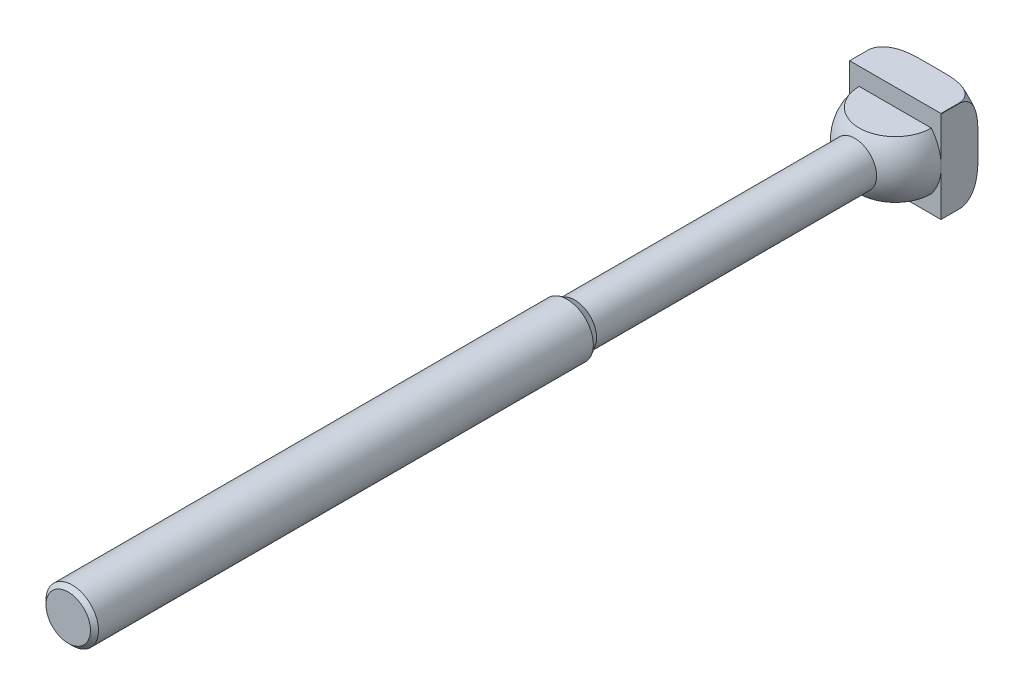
ISO-10303-21;
HEADER;
FILE_DESCRIPTION(('STEP AP214'),'2;1');
FILE_NAME('part.step','',(''),(''),'','','');
FILE_SCHEMA(('AUTOMOTIVE_DESIGN { 1 0 10303 214 1 1 1 1 }'));
ENDSEC;
DATA;
#1=APPLICATION_CONTEXT('core data for automotive mechanical design processes');
#2=APPLICATION_PROTOCOL_DEFINITION('international standard','automotive_design',2000,#1);
#3=PRODUCT_CONTEXT('',#1,'mechanical');
#4=PRODUCT('Part','Part','',(#3));
#5=PRODUCT_RELATED_PRODUCT_CATEGORY('part','',(#4));
#6=PRODUCT_DEFINITION_FORMATION('','',#4);
#7=PRODUCT_DEFINITION_CONTEXT('part definition',#1,'design');
#8=PRODUCT_DEFINITION('design','',#6,#7);
#9=PRODUCT_DEFINITION_SHAPE('','',#8);
#10=(LENGTH_UNIT() NAMED_UNIT(*) SI_UNIT(.MILLI.,.METRE.));
#11=(NAMED_UNIT(*) PLANE_ANGLE_UNIT() SI_UNIT($,.RADIAN.));
#12=(NAMED_UNIT(*) SI_UNIT($,.STERADIAN.) SOLID_ANGLE_UNIT());
#13=UNCERTAINTY_MEASURE_WITH_UNIT(LENGTH_MEASURE(1.E-05),#10,'distance_accuracy_value','');
#14=(GEOMETRIC_REPRESENTATION_CONTEXT(3) GLOBAL_UNCERTAINTY_ASSIGNED_CONTEXT((#13)) GLOBAL_UNIT_ASSIGNED_CONTEXT((#10,
#11,#12)) REPRESENTATION_CONTEXT('',''));
#15=CARTESIAN_POINT('',(0.,0.,0.));
#16=DIRECTION('',(0.,0.,1.));
#17=DIRECTION('',(1.,0.,0.));
#18=AXIS2_PLACEMENT_3D('',#15,#16,#17);
#19=CARTESIAN_POINT('',(0.,0.,-7.));
#20=DIRECTION('',(0.,0.,1.));
#21=DIRECTION('',(0.,1.,0.));
#22=AXIS2_PLACEMENT_3D('',#19,#20,#21);
#23=TOROIDAL_SURFACE('',#22,17.675,7.);
#24=CARTESIAN_POINT('',(-17.5,0.,-13.9978121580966));
#25=CARTESIAN_POINT('',(-17.5,-0.388449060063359,-13.9978135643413));
#26=CARTESIAN_POINT('',(-17.5,-0.776898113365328,-13.9981723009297));
#27=CARTESIAN_POINT('',(-17.5,-1.55379576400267,-13.9991757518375));
#28=CARTESIAN_POINT('',(-17.5,-1.94224436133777,-13.9998204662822));
#29=CARTESIAN_POINT('',(-17.5,-2.71944594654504,-14.0001197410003));
#30=CARTESIAN_POINT('',(-17.5,-3.10819893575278,-13.9997735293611));
#31=CARTESIAN_POINT('',(-17.5,-3.88570470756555,-13.9960499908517));
#32=CARTESIAN_POINT('',(-17.5,-4.27445748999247,-13.9926725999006));
#33=CARTESIAN_POINT('',(-17.5,-5.05178059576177,-13.9801914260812));
#34=CARTESIAN_POINT('',(-17.5,-5.44035094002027,-13.9710891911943));
#35=CARTESIAN_POINT('',(-17.5,-6.21718955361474,-13.9439137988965));
#36=CARTESIAN_POINT('',(-17.5,-6.60545783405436,-13.925840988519));
#37=CARTESIAN_POINT('',(-17.5,-7.38071641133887,-13.8770435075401));
#38=CARTESIAN_POINT('',(-17.5,-7.76770772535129,-13.8463359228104));
#39=CARTESIAN_POINT('',(-17.5,-8.54012803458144,-13.7681554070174));
#40=CARTESIAN_POINT('',(-17.5,-8.92555672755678,-13.7206793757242));
#41=CARTESIAN_POINT('',(-17.5,-9.7004715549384,-13.60339673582));
#42=CARTESIAN_POINT('',(-17.5,-10.0898988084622,-13.5331891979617));
#43=CARTESIAN_POINT('',(-17.5,-10.862789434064,-13.3656834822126));
#44=CARTESIAN_POINT('',(-17.5,-11.2462560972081,-13.2684008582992));
#45=CARTESIAN_POINT('',(-17.5,-12.0018639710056,-13.0419072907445));
#46=CARTESIAN_POINT('',(-17.5,-12.3740499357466,-12.9128485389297));
#47=CARTESIAN_POINT('',(-17.5,-13.1030630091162,-12.6173528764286));
#48=CARTESIAN_POINT('',(-17.5,-13.4599078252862,-12.4509605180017));
#49=CARTESIAN_POINT('',(-17.5,-14.1420716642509,-12.0805223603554));
#50=CARTESIAN_POINT('',(-17.5,-14.4679611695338,-11.8775401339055));
#51=CARTESIAN_POINT('',(-17.5,-15.0887495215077,-11.4272204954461));
#52=CARTESIAN_POINT('',(-17.5,-15.3836232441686,-11.1798475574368));
#53=CARTESIAN_POINT('',(-17.5,-15.7939764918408,-10.7735991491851));
#54=CARTESIAN_POINT('',(-17.5,-15.9261224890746,-10.631366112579));
#55=CARTESIAN_POINT('',(-17.5,-16.1771074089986,-10.3356481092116));
#56=CARTESIAN_POINT('',(-17.5,-16.2959534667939,-10.182169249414));
#57=CARTESIAN_POINT('',(-17.5,-16.5182174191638,-9.86471839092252));
#58=CARTESIAN_POINT('',(-17.5,-16.621657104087,-9.7007616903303));
#59=CARTESIAN_POINT('',(-17.5,-16.8112745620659,-9.36316201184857));
#60=CARTESIAN_POINT('',(-17.5,-16.8974588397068,-9.18952271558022));
#61=CARTESIAN_POINT('',(-17.5,-17.0306833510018,-8.88040626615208));
#62=CARTESIAN_POINT('',(-17.5,-17.0820701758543,-8.74678868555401));
#63=CARTESIAN_POINT('',(-17.5,-17.1737078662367,-8.47579588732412));
#64=CARTESIAN_POINT('',(-17.5,-17.2139608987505,-8.33842140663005));
#65=CARTESIAN_POINT('',(-17.5,-17.2827502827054,-8.06081624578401));
#66=CARTESIAN_POINT('',(-17.5,-17.3112907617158,-7.92058659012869));
#67=CARTESIAN_POINT('',(-17.5,-17.3562505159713,-7.63818623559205));
#68=CARTESIAN_POINT('',(-17.5,-17.3726693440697,-7.49601546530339));
#69=CARTESIAN_POINT('',(-17.5,-17.3931454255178,-7.2105534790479));
#70=CARTESIAN_POINT('',(-17.5,-17.397182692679,-7.06726082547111));
#71=CARTESIAN_POINT('',(-17.5,-17.3927747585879,-6.7808164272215));
#72=CARTESIAN_POINT('',(-17.5,-17.384325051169,-6.63766475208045));
#73=CARTESIAN_POINT('',(-17.5,-17.3550717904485,-6.35267251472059));
#74=CARTESIAN_POINT('',(-17.5,-17.3342716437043,-6.21083160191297));
#75=CARTESIAN_POINT('',(-17.5,-17.2806315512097,-5.92939609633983));
#76=CARTESIAN_POINT('',(-17.5,-17.2477870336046,-5.7898023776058));
#77=CARTESIAN_POINT('',(-17.5,-17.1714713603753,-5.51717596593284));
#78=CARTESIAN_POINT('',(-17.5,-17.1282750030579,-5.38406622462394));
#79=CARTESIAN_POINT('',(-17.5,-17.031454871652,-5.12167690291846));
#80=CARTESIAN_POINT('',(-17.5,-16.9778274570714,-4.99239867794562));
#81=CARTESIAN_POINT('',(-17.5,-16.8023047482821,-4.61143348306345));
#82=CARTESIAN_POINT('',(-17.5,-16.6657030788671,-4.36638565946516));
#83=CARTESIAN_POINT('',(-17.5,-16.3450249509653,-3.87627597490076));
#84=CARTESIAN_POINT('',(-17.5,-16.1576961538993,-3.63337111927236));
#85=CARTESIAN_POINT('',(-17.5,-15.7511437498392,-3.17579814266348));
#86=CARTESIAN_POINT('',(-17.5,-15.5318923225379,-2.96115496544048));
#87=CARTESIAN_POINT('',(-17.5,-15.1166648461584,-2.60199856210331));
#88=CARTESIAN_POINT('',(-17.5,-14.925227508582,-2.45215518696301));
#89=CARTESIAN_POINT('',(-17.5,-14.5298270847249,-2.16994195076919));
#90=CARTESIAN_POINT('',(-17.5,-14.3258580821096,-2.03758043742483));
#91=CARTESIAN_POINT('',(-17.5,-13.6988818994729,-1.6653897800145));
#92=CARTESIAN_POINT('',(-17.5,-13.2609105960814,-1.45054196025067));
#93=CARTESIAN_POINT('',(-17.5,-12.4409472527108,-1.11157031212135));
#94=CARTESIAN_POINT('',(-17.5,-12.0626184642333,-0.97814210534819));
#95=CARTESIAN_POINT('',(-17.5,-11.2955303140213,-0.744772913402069));
#96=CARTESIAN_POINT('',(-17.5,-10.9067630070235,-0.644858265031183));
#97=CARTESIAN_POINT('',(-17.5,-10.121671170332,-0.47277573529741));
#98=CARTESIAN_POINT('',(-17.5,-9.72532251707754,-0.400721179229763));
#99=CARTESIAN_POINT('',(-17.5,-8.92940755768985,-0.27956258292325));
#100=CARTESIAN_POINT('',(-17.5,-8.52984271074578,-0.230448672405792));
#101=CARTESIAN_POINT('',(-17.5,-7.60752790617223,-0.137940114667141));
#102=CARTESIAN_POINT('',(-17.5,-7.08417339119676,-0.100798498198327));
#103=CARTESIAN_POINT('',(-17.5,-6.03635725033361,-0.0469308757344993));
#104=CARTESIAN_POINT('',(-17.5,-5.51189527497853,-0.0302127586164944));
#105=CARTESIAN_POINT('',(-17.5,-4.72472261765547,-0.0140997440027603));
#106=CARTESIAN_POINT('',(-17.5,-4.46208166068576,-0.010223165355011));
#107=CARTESIAN_POINT('',(-17.5,-3.93677626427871,-0.00457927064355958));
#108=CARTESIAN_POINT('',(-17.5,-3.67411182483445,-0.00281195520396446));
#109=CARTESIAN_POINT('',(-17.5,-3.14882284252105,-0.000594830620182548));
#110=CARTESIAN_POINT('',(-17.5,-2.88619830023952,-0.000144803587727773));
#111=CARTESIAN_POINT('',(-17.5,-2.36094969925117,8.43665232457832E-05));
#112=CARTESIAN_POINT('',(-17.5,-2.09832564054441,-0.000136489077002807));
#113=CARTESIAN_POINT('',(-17.5,-1.57325334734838,-0.000754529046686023));
#114=CARTESIAN_POINT('',(-17.5,-1.3108051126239,-0.00115159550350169));
#115=CARTESIAN_POINT('',(-17.5,-0.785908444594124,-0.00179565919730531));
#116=CARTESIAN_POINT('',(-17.5,-0.523460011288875,-0.00204265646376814));
#117=CARTESIAN_POINT('',(-17.5,0.00144887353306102,-0.00223622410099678));
#118=CARTESIAN_POINT('',(-17.5,0.263909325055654,-0.00218278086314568));
#119=CARTESIAN_POINT('',(-17.5,0.788829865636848,-0.00180601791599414));
#120=CARTESIAN_POINT('',(-17.5,1.05128995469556,-0.00148269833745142));
#121=CARTESIAN_POINT('',(-17.5,1.57605180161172,-0.000776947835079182));
#122=CARTESIAN_POINT('',(-17.5,1.83835355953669,-0.000394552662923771));
#123=CARTESIAN_POINT('',(-17.5,2.36295729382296,4.63168922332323E-05));
#124=CARTESIAN_POINT('',(-17.5,2.62525927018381,0.00010479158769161));
#125=CARTESIAN_POINT('',(-17.5,3.149853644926,-0.000647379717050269));
#126=CARTESIAN_POINT('',(-17.5,3.4121460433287,-0.00145799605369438));
#127=CARTESIAN_POINT('',(-17.5,3.93672069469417,-0.00464072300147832));
#128=CARTESIAN_POINT('',(-17.5,4.1990029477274,-0.00701281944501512));
#129=CARTESIAN_POINT('',(-17.5,4.65230158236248,-0.013176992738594));
#130=CARTESIAN_POINT('',(-17.5,4.84332513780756,-0.0164083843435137));
#131=CARTESIAN_POINT('',(-17.5,5.22533824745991,-0.0245003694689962));
#132=CARTESIAN_POINT('',(-17.5,5.41632780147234,-0.0293609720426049));
#133=CARTESIAN_POINT('',(-17.5,5.98924358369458,-0.0469622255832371));
#134=CARTESIAN_POINT('',(-17.5,6.37108844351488,-0.0627220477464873));
#135=CARTESIAN_POINT('',(-17.5,7.13466290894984,-0.105754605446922));
#136=CARTESIAN_POINT('',(-17.5,7.51639171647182,-0.133042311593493));
#137=CARTESIAN_POINT('',(-17.5,8.27847662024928,-0.202989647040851));
#138=CARTESIAN_POINT('',(-17.5,8.65883277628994,-0.245648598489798));
#139=CARTESIAN_POINT('',(-17.5,9.42195850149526,-0.351246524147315));
#140=CARTESIAN_POINT('',(-17.5,9.80469288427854,-0.414447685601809));
#141=CARTESIAN_POINT('',(-17.5,10.5654459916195,-0.565698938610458));
#142=CARTESIAN_POINT('',(-17.5,10.943463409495,-0.653755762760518));
#143=CARTESIAN_POINT('',(-17.5,11.6902728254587,-0.859393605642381));
#144=CARTESIAN_POINT('',(-17.5,12.0590899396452,-0.97688159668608));
#145=CARTESIAN_POINT('',(-17.5,12.7836720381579,-1.24650276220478));
#146=CARTESIAN_POINT('',(-17.5,13.1394491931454,-1.39860262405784));
#147=CARTESIAN_POINT('',(-17.5,13.8415571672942,-1.74733174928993));
#148=CARTESIAN_POINT('',(-17.5,14.1873239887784,-1.94511352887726));
#149=CARTESIAN_POINT('',(-17.5,14.8485763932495,-2.38739698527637));
#150=CARTESIAN_POINT('',(-17.5,15.1640528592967,-2.63191266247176));
#151=CARTESIAN_POINT('',(-17.5,15.6057116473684,-3.03656741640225));
#152=CARTESIAN_POINT('',(-17.5,15.7484799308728,-3.17879792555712));
#153=CARTESIAN_POINT('',(-17.5,16.02058218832,-3.47553091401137));
#154=CARTESIAN_POINT('',(-17.5,16.1499236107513,-3.6300265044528));
#155=CARTESIAN_POINT('',(-17.5,16.392848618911,-3.95063608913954));
#156=CARTESIAN_POINT('',(-17.5,16.5064542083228,-4.11673336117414));
#157=CARTESIAN_POINT('',(-17.5,16.7158362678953,-4.45979707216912));
#158=CARTESIAN_POINT('',(-17.5,16.8116204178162,-4.63675878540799));
#159=CARTESIAN_POINT('',(-17.5,16.9589551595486,-4.94876888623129));
#160=CARTESIAN_POINT('',(-17.5,17.0153588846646,-5.08154294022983));
#161=CARTESIAN_POINT('',(-17.5,17.117142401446,-5.35124238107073));
#162=CARTESIAN_POINT('',(-17.5,17.1625245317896,-5.48816688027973));
#163=CARTESIAN_POINT('',(-17.5,17.2416148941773,-5.76529141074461));
#164=CARTESIAN_POINT('',(-17.5,17.2753279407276,-5.90549006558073));
#165=CARTESIAN_POINT('',(-17.5,17.3306061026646,-6.18827496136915));
#166=CARTESIAN_POINT('',(-17.5,17.3521707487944,-6.3308612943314));
#167=CARTESIAN_POINT('',(-17.5,17.3828473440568,-6.61768637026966));
#168=CARTESIAN_POINT('',(-17.5,17.3919319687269,-6.76192804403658));
#169=CARTESIAN_POINT('',(-17.5,17.3974162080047,-7.05070537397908));
#170=CARTESIAN_POINT('',(-17.5,17.3938112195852,-7.1952411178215));
#171=CARTESIAN_POINT('',(-17.5,17.3739668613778,-7.48339401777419));
#172=CARTESIAN_POINT('',(-17.5,17.3577315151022,-7.62701145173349));
#173=CARTESIAN_POINT('',(-17.5,17.3128806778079,-7.9123497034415));
#174=CARTESIAN_POINT('',(-17.5,17.2842605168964,-8.05406978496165));
#175=CARTESIAN_POINT('',(-17.5,17.216265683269,-8.32972580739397));
#176=CARTESIAN_POINT('',(-17.5,17.1772954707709,-8.46376171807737));
#177=CARTESIAN_POINT('',(-17.5,17.0887514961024,-8.72830148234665));
#178=CARTESIAN_POINT('',(-17.5,17.0391740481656,-8.85880409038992));
#179=CARTESIAN_POINT('',(-17.5,16.8754700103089,-9.2438384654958));
#180=CARTESIAN_POINT('',(-17.5,16.7463149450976,-9.49212171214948));
#181=CARTESIAN_POINT('',(-17.5,16.4418120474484,-9.98701450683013));
#182=CARTESIAN_POINT('',(-17.5,16.2635309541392,-10.2317936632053));
#183=CARTESIAN_POINT('',(-17.5,15.8745026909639,-10.6940423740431));
#184=CARTESIAN_POINT('',(-17.5,15.6637350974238,-10.911494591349));
#185=CARTESIAN_POINT('',(-17.5,15.2660576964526,-11.2735884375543));
#186=CARTESIAN_POINT('',(-17.5,15.0840775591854,-11.4237312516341));
#187=CARTESIAN_POINT('',(-17.5,14.7075403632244,-11.7073892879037));
#188=CARTESIAN_POINT('',(-17.5,14.5129776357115,-11.8408969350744));
#189=CARTESIAN_POINT('',(-17.5,13.9137092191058,-12.2177425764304));
#190=CARTESIAN_POINT('',(-17.5,13.4937742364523,-12.4370952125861));
#191=CARTESIAN_POINT('',(-17.5,12.7133171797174,-12.7823631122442));
#192=CARTESIAN_POINT('',(-17.5,12.3569593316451,-12.9181401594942));
#193=CARTESIAN_POINT('',(-17.5,11.6335174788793,-13.1580292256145));
#194=CARTESIAN_POINT('',(-17.5,11.2664258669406,-13.2621181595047));
#195=CARTESIAN_POINT('',(-17.5,10.5251422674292,-13.443446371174));
#196=CARTESIAN_POINT('',(-17.5,10.1509388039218,-13.5206375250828));
#197=CARTESIAN_POINT('',(-17.5,9.39854189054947,-13.6526484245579));
#198=CARTESIAN_POINT('',(-17.5,9.0203469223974,-13.7074593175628));
#199=CARTESIAN_POINT('',(-17.5,8.28352844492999,-13.7964449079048));
#200=CARTESIAN_POINT('',(-17.5,7.92502154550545,-13.8316198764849));
#201=CARTESIAN_POINT('',(-17.5,7.20708250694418,-13.8893676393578));
#202=CARTESIAN_POINT('',(-17.5,6.84765051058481,-13.911942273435));
#203=CARTESIAN_POINT('',(-17.5,6.12802310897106,-13.9476437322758));
#204=CARTESIAN_POINT('',(-17.5,5.76782730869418,-13.9607621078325));
#205=CARTESIAN_POINT('',(-17.5,5.04725920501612,-13.9803383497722));
#206=CARTESIAN_POINT('',(-17.5,4.68688689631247,-13.9867960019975));
#207=CARTESIAN_POINT('',(-17.5,3.96586036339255,-13.9955068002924));
#208=CARTESIAN_POINT('',(-17.5,3.60520611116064,-13.9977571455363));
#209=CARTESIAN_POINT('',(-17.5,2.88389986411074,-14.0000731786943));
#210=CARTESIAN_POINT('',(-17.5,2.52324786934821,-14.0001389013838));
#211=CARTESIAN_POINT('',(-17.5,1.8021635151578,-13.9996106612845));
#212=CARTESIAN_POINT('',(-17.5,1.44173115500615,-13.9990170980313));
#213=CARTESIAN_POINT('',(-17.5,0.720865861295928,-13.9981171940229));
#214=CARTESIAN_POINT('',(-17.5,0.360432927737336,-13.9978108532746));
#215=CARTESIAN_POINT('',(-17.5,0.,-13.9978121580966));
#216=B_SPLINE_CURVE_WITH_KNOTS('',3,(#24,#25,#26,#27,#28,#29,#30,#31,#32,#33,#34,#35,#36,#37,
#38,#39,#40,#41,#42,#43,#44,#45,#46,#47,#48,#49,#50,#51,#52,#53,#54,#55,#56,#57,#58,#59,#60,#61,
#62,#63,#64,#65,#66,#67,#68,#69,#70,#71,#72,#73,#74,#75,#76,#77,#78,#79,#80,#81,#82,#83,#84,#85,
#86,#87,#88,#89,#90,#91,#92,#93,#94,#95,#96,#97,#98,#99,#100,#101,#102,#103,#104,#105,#106,#107,
#108,#109,#110,#111,#112,#113,#114,#115,#116,#117,#118,#119,#120,#121,#122,#123,#124,#125,#126,
#127,#128,#129,#130,#131,#132,#133,#134,#135,#136,#137,#138,#139,#140,#141,#142,#143,#144,#145,
#146,#147,#148,#149,#150,#151,#152,#153,#154,#155,#156,#157,#158,#159,#160,#161,#162,#163,#164,
#165,#166,#167,#168,#169,#170,#171,#172,#173,#174,#175,#176,#177,#178,#179,#180,#181,#182,#183,
#184,#185,#186,#187,#188,#189,#190,#191,#192,#193,#194,#195,#196,#197,#198,#199,#200,#201,#202,
#203,#204,#205,#206,#207,#208,#209,#210,#211,#212,#213,#214,#215),.UNSPECIFIED.,.T.,.F.,(4,2,2,
2,2,2,2,2,2,2,2,2,2,2,2,2,2,2,2,2,2,2,2,2,2,2,2,2,2,2,2,2,2,2,2,2,2,2,2,2,2,2,2,2,2,2,2,2,2,2,2,
2,2,2,2,2,2,2,2,2,2,2,2,2,2,2,2,2,2,2,2,2,2,2,2,2,2,2,2,2,2,2,2,2,2,2,2,2,2,2,2,2,2,2,2,4),(0.,
1.16534717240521,2.33069485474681,3.49695056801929,4.66323093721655,5.82919608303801,
6.99511612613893,8.15946466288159,9.32402858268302,10.5103669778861,11.6960252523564,
12.8761116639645,14.0547972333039,15.2035486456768,16.353223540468,16.9350159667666,
17.5164947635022,18.09714315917,18.6775722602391,19.1066044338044,19.5355530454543,
19.9643503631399,20.3931634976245,20.8226684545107,21.2523284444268,21.6818699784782,
22.1115747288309,22.5309369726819,22.9504458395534,23.7887527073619,24.7057344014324,
25.6235200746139,26.3518416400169,27.0805097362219,28.5382509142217,29.7401885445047,
30.943068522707,32.150791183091,33.3579937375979,34.9313525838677,36.5053189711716,
37.2933227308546,38.0813267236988,38.8692003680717,39.6570724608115,40.4444181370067,
41.2317636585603,42.019144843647,42.8065256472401,43.5934317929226,44.3803371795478,
45.1672157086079,45.9540870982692,46.5272334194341,47.1003829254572,48.2467673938,
49.3946452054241,50.5424724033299,51.7055662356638,52.8689754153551,54.028752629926,
55.1874182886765,56.3793313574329,57.5716020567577,58.1754983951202,58.7790579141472,
59.3817647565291,59.9842112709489,60.4165476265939,60.8487921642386,61.280858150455,
61.7129408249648,62.1459680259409,62.5791523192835,63.0121986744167,63.4454084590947,
63.8636941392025,64.282125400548,65.1182997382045,66.0235061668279,66.9292840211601,
67.6360904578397,68.3432175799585,69.7588553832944,70.9014301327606,72.0448352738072,
73.1902757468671,74.3361688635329,75.4165796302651,76.4968326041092,77.5780495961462,
78.6593013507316,79.741272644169,80.8232267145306,81.9045254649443,82.9858242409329),.UNSPECIFIED.);
#217=CARTESIAN_POINT('',(-17.5,-2.48105320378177,-14.));
#218=VERTEX_POINT('',#217);
#219=CARTESIAN_POINT('',(-17.5,-17.3955633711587,-7.));
#220=VERTEX_POINT('',#219);
#221=EDGE_CURVE('E140',#218,#220,#216,.T.);
#222=ORIENTED_EDGE('',*,*,#221,.F.);
#223=CARTESIAN_POINT('',(0.,0.,-14.));
#224=DIRECTION('',(0.,0.,1.));
#225=DIRECTION('',(0.,1.,0.));
#226=AXIS2_PLACEMENT_3D('',#223,#224,#225);
#227=CIRCLE('',#226,17.675);
#228=CARTESIAN_POINT('',(-2.48105320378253,-17.5,-14.));
#229=VERTEX_POINT('',#228);
#230=EDGE_CURVE('E239',#218,#229,#227,.T.);
#231=ORIENTED_EDGE('',*,*,#230,.T.);
#232=CARTESIAN_POINT('',(0.,-17.5,-13.9978121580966));
#233=CARTESIAN_POINT('',(0.388449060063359,-17.5,-13.9978135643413));
#234=CARTESIAN_POINT('',(0.776898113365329,-17.5,-13.9981723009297));
#235=CARTESIAN_POINT('',(1.55379576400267,-17.5,-13.9991757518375));
#236=CARTESIAN_POINT('',(1.94224436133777,-17.5,-13.9998204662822));
#237=CARTESIAN_POINT('',(2.71944594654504,-17.5,-14.0001197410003));
#238=CARTESIAN_POINT('',(3.10819893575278,-17.5,-13.9997735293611));
#239=CARTESIAN_POINT('',(3.88570470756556,-17.5,-13.9960499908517));
#240=CARTESIAN_POINT('',(4.27445748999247,-17.5,-13.9926725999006));
#241=CARTESIAN_POINT('',(5.05178059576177,-17.5,-13.9801914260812));
#242=CARTESIAN_POINT('',(5.44035094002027,-17.5,-13.9710891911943));
#243=CARTESIAN_POINT('',(6.21718955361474,-17.5,-13.9439137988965));
#244=CARTESIAN_POINT('',(6.60545783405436,-17.5,-13.925840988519));
#245=CARTESIAN_POINT('',(7.38071641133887,-17.5,-13.8770435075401));
#246=CARTESIAN_POINT('',(7.76770772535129,-17.5,-13.8463359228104));
#247=CARTESIAN_POINT('',(8.54012803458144,-17.5,-13.7681554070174));
#248=CARTESIAN_POINT('',(8.92555672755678,-17.5,-13.7206793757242));
#249=CARTESIAN_POINT('',(9.70047155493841,-17.5,-13.60339673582));
#250=CARTESIAN_POINT('',(10.0898988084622,-17.5,-13.5331891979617));
#251=CARTESIAN_POINT('',(10.862789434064,-17.5,-13.3656834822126));
#252=CARTESIAN_POINT('',(11.2462560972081,-17.5,-13.2684008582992));
#253=CARTESIAN_POINT('',(12.0018639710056,-17.5,-13.0419072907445));
#254=CARTESIAN_POINT('',(12.3740499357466,-17.5,-12.9128485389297));
#255=CARTESIAN_POINT('',(13.1030630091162,-17.5,-12.6173528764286));
#256=CARTESIAN_POINT('',(13.4599078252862,-17.5,-12.4509605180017));
#257=CARTESIAN_POINT('',(14.1420716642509,-17.5,-12.0805223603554));
#258=CARTESIAN_POINT('',(14.4679611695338,-17.5,-11.8775401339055));
#259=CARTESIAN_POINT('',(15.0887495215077,-17.5,-11.4272204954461));
#260=CARTESIAN_POINT('',(15.3836232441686,-17.5,-11.1798475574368));
#261=CARTESIAN_POINT('',(15.7939764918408,-17.5,-10.7735991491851));
#262=CARTESIAN_POINT('',(15.9261224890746,-17.5,-10.631366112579));
#263=CARTESIAN_POINT('',(16.1771074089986,-17.5,-10.3356481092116));
#264=CARTESIAN_POINT('',(16.2959534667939,-17.5,-10.182169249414));
#265=CARTESIAN_POINT('',(16.5182174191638,-17.5,-9.86471839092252));
#266=CARTESIAN_POINT('',(16.621657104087,-17.5,-9.7007616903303));
#267=CARTESIAN_POINT('',(16.8112745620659,-17.5,-9.36316201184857));
#268=CARTESIAN_POINT('',(16.8974588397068,-17.5,-9.18952271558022));
#269=CARTESIAN_POINT('',(17.0306833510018,-17.5,-8.88040626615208));
#270=CARTESIAN_POINT('',(17.0820701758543,-17.5,-8.74678868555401));
#271=CARTESIAN_POINT('',(17.1737078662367,-17.5,-8.47579588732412));
#272=CARTESIAN_POINT('',(17.2139608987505,-17.5,-8.33842140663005));
#273=CARTESIAN_POINT('',(17.2827502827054,-17.5,-8.06081624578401));
#274=CARTESIAN_POINT('',(17.3112907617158,-17.5,-7.92058659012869));
#275=CARTESIAN_POINT('',(17.3562505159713,-17.5,-7.63818623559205));
#276=CARTESIAN_POINT('',(17.3726693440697,-17.5,-7.4960154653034));
#277=CARTESIAN_POINT('',(17.3931454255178,-17.5,-7.2105534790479));
#278=CARTESIAN_POINT('',(17.397182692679,-17.5,-7.06726082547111));
#279=CARTESIAN_POINT('',(17.3927747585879,-17.5,-6.78081642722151));
#280=CARTESIAN_POINT('',(17.384325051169,-17.5,-6.63766475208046));
#281=CARTESIAN_POINT('',(17.3550717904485,-17.5,-6.35267251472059));
#282=CARTESIAN_POINT('',(17.3342716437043,-17.5,-6.21083160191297));
#283=CARTESIAN_POINT('',(17.2806315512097,-17.5,-5.92939609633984));
#284=CARTESIAN_POINT('',(17.2477870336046,-17.5,-5.78980237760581));
#285=CARTESIAN_POINT('',(17.1714713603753,-17.5,-5.51717596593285));
#286=CARTESIAN_POINT('',(17.1282750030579,-17.5,-5.38406622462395));
#287=CARTESIAN_POINT('',(17.031454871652,-17.5,-5.12167690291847));
#288=CARTESIAN_POINT('',(16.9778274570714,-17.5,-4.99239867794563));
#289=CARTESIAN_POINT('',(16.8023047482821,-17.5,-4.61143348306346));
#290=CARTESIAN_POINT('',(16.6657030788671,-17.5,-4.36638565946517));
#291=CARTESIAN_POINT('',(16.3450249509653,-17.5,-3.87627597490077));
#292=CARTESIAN_POINT('',(16.1576961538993,-17.5,-3.63337111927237));
#293=CARTESIAN_POINT('',(15.7511437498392,-17.5,-3.17579814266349));
#294=CARTESIAN_POINT('',(15.5318923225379,-17.5,-2.96115496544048));
#295=CARTESIAN_POINT('',(15.1166648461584,-17.5,-2.60199856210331));
#296=CARTESIAN_POINT('',(14.925227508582,-17.5,-2.45215518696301));
#297=CARTESIAN_POINT('',(14.5298270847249,-17.5,-2.1699419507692));
#298=CARTESIAN_POINT('',(14.3258580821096,-17.5,-2.03758043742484));
#299=CARTESIAN_POINT('',(13.6988818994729,-17.5,-1.66538978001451));
#300=CARTESIAN_POINT('',(13.2609105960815,-17.5,-1.45054196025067));
#301=CARTESIAN_POINT('',(12.4409472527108,-17.5,-1.11157031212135));
#302=CARTESIAN_POINT('',(12.0626184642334,-17.5,-0.978142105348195));
#303=CARTESIAN_POINT('',(11.2955303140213,-17.5,-0.744772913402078));
#304=CARTESIAN_POINT('',(10.9067630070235,-17.5,-0.64485826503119));
#305=CARTESIAN_POINT('',(10.121671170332,-17.5,-0.472775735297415));
#306=CARTESIAN_POINT('',(9.72532251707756,-17.5,-0.400721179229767));
#307=CARTESIAN_POINT('',(8.92940755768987,-17.5,-0.279562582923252));
#308=CARTESIAN_POINT('',(8.5298427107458,-17.5,-0.230448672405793));
#309=CARTESIAN_POINT('',(7.60752790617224,-17.5,-0.13794011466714));
#310=CARTESIAN_POINT('',(7.08417339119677,-17.5,-0.100798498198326));
#311=CARTESIAN_POINT('',(6.03635725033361,-17.5,-0.0469308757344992));
#312=CARTESIAN_POINT('',(5.51189527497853,-17.5,-0.0302127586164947));
#313=CARTESIAN_POINT('',(4.72472261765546,-17.5,-0.0140997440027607));
#314=CARTESIAN_POINT('',(4.46208166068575,-17.5,-0.0102231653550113));
#315=CARTESIAN_POINT('',(3.9367762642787,-17.5,-0.00457927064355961));
#316=CARTESIAN_POINT('',(3.67411182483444,-17.5,-0.00281195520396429));
#317=CARTESIAN_POINT('',(3.14882284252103,-17.5,-0.000594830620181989));
#318=CARTESIAN_POINT('',(2.88619830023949,-17.5,-0.000144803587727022));
#319=CARTESIAN_POINT('',(2.36094969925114,-17.5,8.43665232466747E-05));
#320=CARTESIAN_POINT('',(2.09832564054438,-17.5,-0.000136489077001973));
#321=CARTESIAN_POINT('',(1.57325334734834,-17.5,-0.000754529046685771));
#322=CARTESIAN_POINT('',(1.31080511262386,-17.5,-0.00115159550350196));
#323=CARTESIAN_POINT('',(0.785908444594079,-17.5,-0.00179565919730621));
#324=CARTESIAN_POINT('',(0.52346001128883,-17.5,-0.00204265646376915));
#325=CARTESIAN_POINT('',(-0.00144887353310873,-17.5,-0.002236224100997));
#326=CARTESIAN_POINT('',(-0.263909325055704,-17.5,-0.00218278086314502));
#327=CARTESIAN_POINT('',(-0.788829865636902,-17.5,-0.00180601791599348));
#328=CARTESIAN_POINT('',(-1.05128995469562,-17.5,-0.00148269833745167));
#329=CARTESIAN_POINT('',(-1.57605180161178,-17.5,-0.000776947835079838));
#330=CARTESIAN_POINT('',(-1.83835355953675,-17.5,-0.000394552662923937));
#331=CARTESIAN_POINT('',(-2.36295729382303,-17.5,4.63168922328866E-05));
#332=CARTESIAN_POINT('',(-2.62525927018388,-17.5,0.000104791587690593));
#333=CARTESIAN_POINT('',(-3.14985364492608,-17.5,-0.000647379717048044));
#334=CARTESIAN_POINT('',(-3.41214604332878,-17.5,-0.00145799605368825));
#335=CARTESIAN_POINT('',(-3.93672069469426,-17.5,-0.00464072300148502));
#336=CARTESIAN_POINT('',(-4.19900294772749,-17.5,-0.00701281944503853));
#337=CARTESIAN_POINT('',(-4.65230158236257,-17.5,-0.0131769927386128));
#338=CARTESIAN_POINT('',(-4.84332513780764,-17.5,-0.0164083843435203));
#339=CARTESIAN_POINT('',(-5.22533824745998,-17.5,-0.0245003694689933));
#340=CARTESIAN_POINT('',(-5.41632780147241,-17.5,-0.0293609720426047));
#341=CARTESIAN_POINT('',(-5.98924358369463,-17.5,-0.0469622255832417));
#342=CARTESIAN_POINT('',(-6.37108844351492,-17.5,-0.0627220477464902));
#343=CARTESIAN_POINT('',(-7.13466290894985,-17.5,-0.105754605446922));
#344=CARTESIAN_POINT('',(-7.51639171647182,-17.5,-0.133042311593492));
#345=CARTESIAN_POINT('',(-8.27847662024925,-17.5,-0.20298964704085));
#346=CARTESIAN_POINT('',(-8.65883277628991,-17.5,-0.2456485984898));
#347=CARTESIAN_POINT('',(-9.4219585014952,-17.5,-0.351246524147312));
#348=CARTESIAN_POINT('',(-9.80469288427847,-17.5,-0.414447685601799));
#349=CARTESIAN_POINT('',(-10.5654459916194,-17.5,-0.565698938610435));
#350=CARTESIAN_POINT('',(-10.9434634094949,-17.5,-0.653755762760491));
#351=CARTESIAN_POINT('',(-11.6902728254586,-17.5,-0.859393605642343));
#352=CARTESIAN_POINT('',(-12.059089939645,-17.5,-0.976881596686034));
#353=CARTESIAN_POINT('',(-12.7836720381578,-17.5,-1.24650276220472));
#354=CARTESIAN_POINT('',(-13.1394491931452,-17.5,-1.39860262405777));
#355=CARTESIAN_POINT('',(-13.8415571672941,-17.5,-1.74733174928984));
#356=CARTESIAN_POINT('',(-14.1873239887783,-17.5,-1.94511352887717));
#357=CARTESIAN_POINT('',(-14.8485763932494,-17.5,-2.38739698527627));
#358=CARTESIAN_POINT('',(-15.1640528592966,-17.5,-2.63191266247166));
#359=CARTESIAN_POINT('',(-15.6057116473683,-17.5,-3.03656741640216));
#360=CARTESIAN_POINT('',(-15.7484799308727,-17.5,-3.17879792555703));
#361=CARTESIAN_POINT('',(-16.0205821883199,-17.5,-3.47553091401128));
#362=CARTESIAN_POINT('',(-16.1499236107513,-17.5,-3.63002650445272));
#363=CARTESIAN_POINT('',(-16.392848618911,-17.5,-3.95063608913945));
#364=CARTESIAN_POINT('',(-16.5064542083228,-17.5,-4.11673336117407));
#365=CARTESIAN_POINT('',(-16.7158362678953,-17.5,-4.45979707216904));
#366=CARTESIAN_POINT('',(-16.8116204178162,-17.5,-4.6367587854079));
#367=CARTESIAN_POINT('',(-16.9589551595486,-17.5,-4.9487688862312));
#368=CARTESIAN_POINT('',(-17.0153588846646,-17.5,-5.08154294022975));
#369=CARTESIAN_POINT('',(-17.117142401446,-17.5,-5.35124238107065));
#370=CARTESIAN_POINT('',(-17.1625245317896,-17.5,-5.48816688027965));
#371=CARTESIAN_POINT('',(-17.2416148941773,-17.5,-5.76529141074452));
#372=CARTESIAN_POINT('',(-17.2753279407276,-17.5,-5.90549006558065));
#373=CARTESIAN_POINT('',(-17.3306061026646,-17.5,-6.18827496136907));
#374=CARTESIAN_POINT('',(-17.3521707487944,-17.5,-6.33086129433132));
#375=CARTESIAN_POINT('',(-17.3828473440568,-17.5,-6.61768637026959));
#376=CARTESIAN_POINT('',(-17.3919319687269,-17.5,-6.76192804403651));
#377=CARTESIAN_POINT('',(-17.3974162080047,-17.5,-7.050705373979));
#378=CARTESIAN_POINT('',(-17.3938112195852,-17.5,-7.19524111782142));
#379=CARTESIAN_POINT('',(-17.3739668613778,-17.5,-7.48339401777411));
#380=CARTESIAN_POINT('',(-17.3577315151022,-17.5,-7.62701145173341));
#381=CARTESIAN_POINT('',(-17.3128806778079,-17.5,-7.91234970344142));
#382=CARTESIAN_POINT('',(-17.2842605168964,-17.5,-8.05406978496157));
#383=CARTESIAN_POINT('',(-17.2162656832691,-17.5,-8.32972580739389));
#384=CARTESIAN_POINT('',(-17.1772954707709,-17.5,-8.4637617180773));
#385=CARTESIAN_POINT('',(-17.0887514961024,-17.5,-8.72830148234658));
#386=CARTESIAN_POINT('',(-17.0391740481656,-17.5,-8.85880409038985));
#387=CARTESIAN_POINT('',(-16.875470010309,-17.5,-9.24383846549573));
#388=CARTESIAN_POINT('',(-16.7463149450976,-17.5,-9.49212171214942));
#389=CARTESIAN_POINT('',(-16.4418120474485,-17.5,-9.98701450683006));
#390=CARTESIAN_POINT('',(-16.2635309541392,-17.5,-10.2317936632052));
#391=CARTESIAN_POINT('',(-15.8745026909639,-17.5,-10.694042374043));
#392=CARTESIAN_POINT('',(-15.6637350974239,-17.5,-10.9114945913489));
#393=CARTESIAN_POINT('',(-15.2660576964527,-17.5,-11.2735884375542));
#394=CARTESIAN_POINT('',(-15.0840775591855,-17.5,-11.423731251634));
#395=CARTESIAN_POINT('',(-14.7075403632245,-17.5,-11.7073892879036));
#396=CARTESIAN_POINT('',(-14.5129776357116,-17.5,-11.8408969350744));
#397=CARTESIAN_POINT('',(-13.9137092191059,-17.5,-12.2177425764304));
#398=CARTESIAN_POINT('',(-13.4937742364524,-17.5,-12.437095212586));
#399=CARTESIAN_POINT('',(-12.7133171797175,-17.5,-12.7823631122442));
#400=CARTESIAN_POINT('',(-12.3569593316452,-17.5,-12.9181401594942));
#401=CARTESIAN_POINT('',(-11.6335174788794,-17.5,-13.1580292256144));
#402=CARTESIAN_POINT('',(-11.2664258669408,-17.5,-13.2621181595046));
#403=CARTESIAN_POINT('',(-10.5251422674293,-17.5,-13.4434463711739));
#404=CARTESIAN_POINT('',(-10.1509388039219,-17.5,-13.5206375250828));
#405=CARTESIAN_POINT('',(-9.39854189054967,-17.5,-13.6526484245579));
#406=CARTESIAN_POINT('',(-9.02034692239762,-17.5,-13.7074593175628));
#407=CARTESIAN_POINT('',(-8.28352844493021,-17.5,-13.7964449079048));
#408=CARTESIAN_POINT('',(-7.92502154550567,-17.5,-13.8316198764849));
#409=CARTESIAN_POINT('',(-7.20708250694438,-17.5,-13.8893676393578));
#410=CARTESIAN_POINT('',(-6.847650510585,-17.5,-13.911942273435));
#411=CARTESIAN_POINT('',(-6.12802310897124,-17.5,-13.9476437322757));
#412=CARTESIAN_POINT('',(-5.76782730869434,-17.5,-13.9607621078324));
#413=CARTESIAN_POINT('',(-5.04725920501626,-17.5,-13.9803383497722));
#414=CARTESIAN_POINT('',(-4.68688689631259,-17.5,-13.9867960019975));
#415=CARTESIAN_POINT('',(-3.96586036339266,-17.5,-13.9955068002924));
#416=CARTESIAN_POINT('',(-3.60520611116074,-17.5,-13.9977571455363));
#417=CARTESIAN_POINT('',(-2.88389986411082,-17.5,-14.0000731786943));
#418=CARTESIAN_POINT('',(-2.52324786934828,-17.5,-14.0001389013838));
#419=CARTESIAN_POINT('',(-1.80216351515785,-17.5,-13.9996106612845));
#420=CARTESIAN_POINT('',(-1.44173115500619,-17.5,-13.9990170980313));
#421=CARTESIAN_POINT('',(-0.720865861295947,-17.5,-13.9981171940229));
#422=CARTESIAN_POINT('',(-0.360432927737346,-17.5,-13.9978108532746));
#423=CARTESIAN_POINT('',(0.,-17.5,-13.9978121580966));
#424=B_SPLINE_CURVE_WITH_KNOTS('',3,(#232,#233,#234,#235,#236,#237,#238,#239,#240,#241,#242,
#243,#244,#245,#246,#247,#248,#249,#250,#251,#252,#253,#254,#255,#256,#257,#258,#259,#260,#261,
#262,#263,#264,#265,#266,#267,#268,#269,#270,#271,#272,#273,#274,#275,#276,#277,#278,#279,#280,
#281,#282,#283,#284,#285,#286,#287,#288,#289,#290,#291,#292,#293,#294,#295,#296,#297,#298,#299,
#300,#301,#302,#303,#304,#305,#306,#307,#308,#309,#310,#311,#312,#313,#314,#315,#316,#317,#318,
#319,#320,#321,#322,#323,#324,#325,#326,#327,#328,#329,#330,#331,#332,#333,#334,#335,#336,#337,
#338,#339,#340,#341,#342,#343,#344,#345,#346,#347,#348,#349,#350,#351,#352,#353,#354,#355,#356,
#357,#358,#359,#360,#361,#362,#363,#364,#365,#366,#367,#368,#369,#370,#371,#372,#373,#374,#375,
#376,#377,#378,#379,#380,#381,#382,#383,#384,#385,#386,#387,#388,#389,#390,#391,#392,#393,#394,
#395,#396,#397,#398,#399,#400,#401,#402,#403,#404,#405,#406,#407,#408,#409,#410,#411,#412,#413,
#414,#415,#416,#417,#418,#419,#420,#421,#422,#423),.UNSPECIFIED.,.T.,.F.,(4,2,2,2,2,2,2,2,2,2,2,
2,2,2,2,2,2,2,2,2,2,2,2,2,2,2,2,2,2,2,2,2,2,2,2,2,2,2,2,2,2,2,2,2,2,2,2,2,2,2,2,2,2,2,2,2,2,2,2,
2,2,2,2,2,2,2,2,2,2,2,2,2,2,2,2,2,2,2,2,2,2,2,2,2,2,2,2,2,2,2,2,2,2,2,2,4),(0.,1.16534717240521,
2.33069485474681,3.4969505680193,4.66323093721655,5.82919608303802,6.99511612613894,
8.15946466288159,9.32402858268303,10.5103669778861,11.6960252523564,12.8761116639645,
14.0547972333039,15.2035486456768,16.353223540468,16.9350159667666,17.5164947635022,
18.09714315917,18.6775722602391,19.1066044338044,19.5355530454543,19.9643503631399,
20.3931634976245,20.8226684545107,21.2523284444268,21.6818699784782,22.1115747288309,
22.5309369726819,22.9504458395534,23.7887527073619,24.7057344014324,25.6235200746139,
26.3518416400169,27.0805097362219,28.5382509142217,29.7401885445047,30.943068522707,
32.1507911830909,33.3579937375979,34.9313525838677,36.5053189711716,37.2933227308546,
38.0813267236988,38.8692003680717,39.6570724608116,40.4444181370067,41.2317636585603,
42.0191448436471,42.8065256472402,43.5934317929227,44.3803371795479,45.167215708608,
45.9540870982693,46.5272334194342,47.1003829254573,48.2467673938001,49.3946452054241,
50.5424724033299,51.7055662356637,52.868975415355,54.0287526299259,55.1874182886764,
56.3793313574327,57.5716020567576,58.1754983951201,58.7790579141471,59.381764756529,
59.9842112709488,60.4165476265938,60.8487921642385,61.2808581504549,61.7129408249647,
62.1459680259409,62.5791523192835,63.0121986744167,63.4454084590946,63.8636941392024,
64.282125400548,65.1182997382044,66.0235061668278,66.92928402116,67.6360904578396,
68.3432175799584,69.7588553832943,70.9014301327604,72.044835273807,73.190275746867,
74.3361688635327,75.4165796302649,76.496832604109,77.5780495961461,78.6593013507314,
79.7412726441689,80.8232267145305,81.9045254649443,82.9858242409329),.UNSPECIFIED.);
#425=CARTESIAN_POINT('',(-17.3955633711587,-17.5,-7.));
#426=VERTEX_POINT('',#425);
#427=EDGE_CURVE('E177',#426,#229,#424,.T.);
#428=ORIENTED_EDGE('',*,*,#427,.F.);
#429=CARTESIAN_POINT('',(0.,0.,-7.));
#430=DIRECTION('',(0.,0.,1.));
#431=DIRECTION('',(0.,1.,0.));
#432=AXIS2_PLACEMENT_3D('',#429,#430,#431);
#433=CIRCLE('',#432,24.675);
#434=EDGE_CURVE('E174',#220,#426,#433,.T.);
#435=ORIENTED_EDGE('',*,*,#434,.F.);
#436=EDGE_LOOP('',(#222,#231,#428,#435));
#437=FACE_BOUND('',#436,.T.);
#438=ADVANCED_FACE('F14',(#437),#23,.T.);
#439=CARTESIAN_POINT('',(2.48105320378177,-17.5,-14.));
#440=VERTEX_POINT('',#439);
#441=CARTESIAN_POINT('',(17.3955633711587,-17.5,-7.));
#442=VERTEX_POINT('',#441);
#443=EDGE_CURVE('E180',#440,#442,#424,.T.);
#444=ORIENTED_EDGE('',*,*,#443,.F.);
#445=CARTESIAN_POINT('',(17.5,-2.48105320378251,-14.));
#446=VERTEX_POINT('',#445);
#447=EDGE_CURVE('E338',#440,#446,#227,.T.);
#448=ORIENTED_EDGE('',*,*,#447,.T.);
#449=CARTESIAN_POINT('',(17.5,0.,-13.9978121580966));
#450=CARTESIAN_POINT('',(17.5,0.388449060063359,-13.9978135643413));
#451=CARTESIAN_POINT('',(17.5,0.776898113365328,-13.9981723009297));
#452=CARTESIAN_POINT('',(17.5,1.55379576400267,-13.9991757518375));
#453=CARTESIAN_POINT('',(17.5,1.94224436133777,-13.9998204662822));
#454=CARTESIAN_POINT('',(17.5,2.71944594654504,-14.0001197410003));
#455=CARTESIAN_POINT('',(17.5,3.10819893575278,-13.9997735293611));
#456=CARTESIAN_POINT('',(17.5,3.88570470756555,-13.9960499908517));
#457=CARTESIAN_POINT('',(17.5,4.27445748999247,-13.9926725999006));
#458=CARTESIAN_POINT('',(17.5,5.05178059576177,-13.9801914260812));
#459=CARTESIAN_POINT('',(17.5,5.44035094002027,-13.9710891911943));
#460=CARTESIAN_POINT('',(17.5,6.21718955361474,-13.9439137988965));
#461=CARTESIAN_POINT('',(17.5,6.60545783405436,-13.925840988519));
#462=CARTESIAN_POINT('',(17.5,7.38071641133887,-13.8770435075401));
#463=CARTESIAN_POINT('',(17.5,7.76770772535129,-13.8463359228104));
#464=CARTESIAN_POINT('',(17.5,8.54012803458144,-13.7681554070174));
#465=CARTESIAN_POINT('',(17.5,8.92555672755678,-13.7206793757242));
#466=CARTESIAN_POINT('',(17.5,9.7004715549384,-13.60339673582));
#467=CARTESIAN_POINT('',(17.5,10.0898988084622,-13.5331891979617));
#468=CARTESIAN_POINT('',(17.5,10.862789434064,-13.3656834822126));
#469=CARTESIAN_POINT('',(17.5,11.2462560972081,-13.2684008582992));
#470=CARTESIAN_POINT('',(17.5,12.0018639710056,-13.0419072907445));
#471=CARTESIAN_POINT('',(17.5,12.3740499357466,-12.9128485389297));
#472=CARTESIAN_POINT('',(17.5,13.1030630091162,-12.6173528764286));
#473=CARTESIAN_POINT('',(17.5,13.4599078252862,-12.4509605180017));
#474=CARTESIAN_POINT('',(17.5,14.1420716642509,-12.0805223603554));
#475=CARTESIAN_POINT('',(17.5,14.4679611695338,-11.8775401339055));
#476=CARTESIAN_POINT('',(17.5,15.0887495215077,-11.4272204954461));
#477=CARTESIAN_POINT('',(17.5,15.3836232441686,-11.1798475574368));
#478=CARTESIAN_POINT('',(17.5,15.7939764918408,-10.7735991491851));
#479=CARTESIAN_POINT('',(17.5,15.9261224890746,-10.631366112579));
#480=CARTESIAN_POINT('',(17.5,16.1771074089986,-10.3356481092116));
#481=CARTESIAN_POINT('',(17.5,16.2959534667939,-10.182169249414));
#482=CARTESIAN_POINT('',(17.5,16.5182174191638,-9.86471839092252));
#483=CARTESIAN_POINT('',(17.5,16.621657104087,-9.7007616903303));
#484=CARTESIAN_POINT('',(17.5,16.8112745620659,-9.36316201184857));
#485=CARTESIAN_POINT('',(17.5,16.8974588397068,-9.18952271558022));
#486=CARTESIAN_POINT('',(17.5,17.0306833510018,-8.88040626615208));
#487=CARTESIAN_POINT('',(17.5,17.0820701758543,-8.74678868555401));
#488=CARTESIAN_POINT('',(17.5,17.1737078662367,-8.47579588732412));
#489=CARTESIAN_POINT('',(17.5,17.2139608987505,-8.33842140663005));
#490=CARTESIAN_POINT('',(17.5,17.2827502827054,-8.06081624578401));
#491=CARTESIAN_POINT('',(17.5,17.3112907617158,-7.92058659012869));
#492=CARTESIAN_POINT('',(17.5,17.3562505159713,-7.63818623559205));
#493=CARTESIAN_POINT('',(17.5,17.3726693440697,-7.49601546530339));
#494=CARTESIAN_POINT('',(17.5,17.3931454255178,-7.2105534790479));
#495=CARTESIAN_POINT('',(17.5,17.397182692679,-7.06726082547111));
#496=CARTESIAN_POINT('',(17.5,17.3927747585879,-6.7808164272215));
#497=CARTESIAN_POINT('',(17.5,17.384325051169,-6.63766475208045));
#498=CARTESIAN_POINT('',(17.5,17.3550717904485,-6.35267251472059));
#499=CARTESIAN_POINT('',(17.5,17.3342716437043,-6.21083160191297));
#500=CARTESIAN_POINT('',(17.5,17.2806315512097,-5.92939609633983));
#501=CARTESIAN_POINT('',(17.5,17.2477870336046,-5.7898023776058));
#502=CARTESIAN_POINT('',(17.5,17.1714713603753,-5.51717596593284));
#503=CARTESIAN_POINT('',(17.5,17.1282750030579,-5.38406622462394));
#504=CARTESIAN_POINT('',(17.5,17.031454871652,-5.12167690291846));
#505=CARTESIAN_POINT('',(17.5,16.9778274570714,-4.99239867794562));
#506=CARTESIAN_POINT('',(17.5,16.8023047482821,-4.61143348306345));
#507=CARTESIAN_POINT('',(17.5,16.6657030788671,-4.36638565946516));
#508=CARTESIAN_POINT('',(17.5,16.3450249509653,-3.87627597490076));
#509=CARTESIAN_POINT('',(17.5,16.1576961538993,-3.63337111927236));
#510=CARTESIAN_POINT('',(17.5,15.7511437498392,-3.17579814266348));
#511=CARTESIAN_POINT('',(17.5,15.5318923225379,-2.96115496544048));
#512=CARTESIAN_POINT('',(17.5,15.1166648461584,-2.60199856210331));
#513=CARTESIAN_POINT('',(17.5,14.925227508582,-2.45215518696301));
#514=CARTESIAN_POINT('',(17.5,14.5298270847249,-2.16994195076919));
#515=CARTESIAN_POINT('',(17.5,14.3258580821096,-2.03758043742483));
#516=CARTESIAN_POINT('',(17.5,13.6988818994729,-1.6653897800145));
#517=CARTESIAN_POINT('',(17.5,13.2609105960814,-1.45054196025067));
#518=CARTESIAN_POINT('',(17.5,12.4409472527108,-1.11157031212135));
#519=CARTESIAN_POINT('',(17.5,12.0626184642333,-0.97814210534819));
#520=CARTESIAN_POINT('',(17.5,11.2955303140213,-0.744772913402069));
#521=CARTESIAN_POINT('',(17.5,10.9067630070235,-0.644858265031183));
#522=CARTESIAN_POINT('',(17.5,10.121671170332,-0.47277573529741));
#523=CARTESIAN_POINT('',(17.5,9.72532251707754,-0.400721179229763));
#524=CARTESIAN_POINT('',(17.5,8.92940755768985,-0.27956258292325));
#525=CARTESIAN_POINT('',(17.5,8.52984271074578,-0.230448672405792));
#526=CARTESIAN_POINT('',(17.5,7.60752790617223,-0.137940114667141));
#527=CARTESIAN_POINT('',(17.5,7.08417339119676,-0.100798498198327));
#528=CARTESIAN_POINT('',(17.5,6.03635725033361,-0.0469308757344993));
#529=CARTESIAN_POINT('',(17.5,5.51189527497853,-0.0302127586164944));
#530=CARTESIAN_POINT('',(17.5,4.72472261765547,-0.0140997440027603));
#531=CARTESIAN_POINT('',(17.5,4.46208166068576,-0.010223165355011));
#532=CARTESIAN_POINT('',(17.5,3.93677626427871,-0.00457927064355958));
#533=CARTESIAN_POINT('',(17.5,3.67411182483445,-0.00281195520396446));
#534=CARTESIAN_POINT('',(17.5,3.14882284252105,-0.000594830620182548));
#535=CARTESIAN_POINT('',(17.5,2.88619830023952,-0.000144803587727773));
#536=CARTESIAN_POINT('',(17.5,2.36094969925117,8.43665232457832E-05));
#537=CARTESIAN_POINT('',(17.5,2.09832564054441,-0.000136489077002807));
#538=CARTESIAN_POINT('',(17.5,1.57325334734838,-0.000754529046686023));
#539=CARTESIAN_POINT('',(17.5,1.3108051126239,-0.00115159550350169));
#540=CARTESIAN_POINT('',(17.5,0.785908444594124,-0.00179565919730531));
#541=CARTESIAN_POINT('',(17.5,0.523460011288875,-0.00204265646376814));
#542=CARTESIAN_POINT('',(17.5,-0.00144887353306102,-0.00223622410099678));
#543=CARTESIAN_POINT('',(17.5,-0.263909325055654,-0.00218278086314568));
#544=CARTESIAN_POINT('',(17.5,-0.788829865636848,-0.00180601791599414));
#545=CARTESIAN_POINT('',(17.5,-1.05128995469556,-0.00148269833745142));
#546=CARTESIAN_POINT('',(17.5,-1.57605180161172,-0.000776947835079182));
#547=CARTESIAN_POINT('',(17.5,-1.83835355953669,-0.000394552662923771));
#548=CARTESIAN_POINT('',(17.5,-2.36295729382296,4.63168922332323E-05));
#549=CARTESIAN_POINT('',(17.5,-2.62525927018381,0.00010479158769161));
#550=CARTESIAN_POINT('',(17.5,-3.149853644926,-0.000647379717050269));
#551=CARTESIAN_POINT('',(17.5,-3.4121460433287,-0.00145799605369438));
#552=CARTESIAN_POINT('',(17.5,-3.93672069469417,-0.00464072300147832));
#553=CARTESIAN_POINT('',(17.5,-4.1990029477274,-0.00701281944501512));
#554=CARTESIAN_POINT('',(17.5,-4.65230158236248,-0.013176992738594));
#555=CARTESIAN_POINT('',(17.5,-4.84332513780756,-0.0164083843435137));
#556=CARTESIAN_POINT('',(17.5,-5.22533824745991,-0.0245003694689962));
#557=CARTESIAN_POINT('',(17.5,-5.41632780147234,-0.0293609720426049));
#558=CARTESIAN_POINT('',(17.5,-5.98924358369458,-0.0469622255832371));
#559=CARTESIAN_POINT('',(17.5,-6.37108844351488,-0.0627220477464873));
#560=CARTESIAN_POINT('',(17.5,-7.13466290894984,-0.105754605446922));
#561=CARTESIAN_POINT('',(17.5,-7.51639171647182,-0.133042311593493));
#562=CARTESIAN_POINT('',(17.5,-8.27847662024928,-0.202989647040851));
#563=CARTESIAN_POINT('',(17.5,-8.65883277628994,-0.245648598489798));
#564=CARTESIAN_POINT('',(17.5,-9.42195850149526,-0.351246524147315));
#565=CARTESIAN_POINT('',(17.5,-9.80469288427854,-0.414447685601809));
#566=CARTESIAN_POINT('',(17.5,-10.5654459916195,-0.565698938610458));
#567=CARTESIAN_POINT('',(17.5,-10.943463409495,-0.653755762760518));
#568=CARTESIAN_POINT('',(17.5,-11.6902728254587,-0.859393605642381));
#569=CARTESIAN_POINT('',(17.5,-12.0590899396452,-0.97688159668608));
#570=CARTESIAN_POINT('',(17.5,-12.7836720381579,-1.24650276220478));
#571=CARTESIAN_POINT('',(17.5,-13.1394491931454,-1.39860262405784));
#572=CARTESIAN_POINT('',(17.5,-13.8415571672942,-1.74733174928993));
#573=CARTESIAN_POINT('',(17.5,-14.1873239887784,-1.94511352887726));
#574=CARTESIAN_POINT('',(17.5,-14.8485763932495,-2.38739698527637));
#575=CARTESIAN_POINT('',(17.5,-15.1640528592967,-2.63191266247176));
#576=CARTESIAN_POINT('',(17.5,-15.6057116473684,-3.03656741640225));
#577=CARTESIAN_POINT('',(17.5,-15.7484799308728,-3.17879792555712));
#578=CARTESIAN_POINT('',(17.5,-16.02058218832,-3.47553091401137));
#579=CARTESIAN_POINT('',(17.5,-16.1499236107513,-3.6300265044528));
#580=CARTESIAN_POINT('',(17.5,-16.392848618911,-3.95063608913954));
#581=CARTESIAN_POINT('',(17.5,-16.5064542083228,-4.11673336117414));
#582=CARTESIAN_POINT('',(17.5,-16.7158362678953,-4.45979707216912));
#583=CARTESIAN_POINT('',(17.5,-16.8116204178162,-4.63675878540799));
#584=CARTESIAN_POINT('',(17.5,-16.9589551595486,-4.94876888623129));
#585=CARTESIAN_POINT('',(17.5,-17.0153588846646,-5.08154294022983));
#586=CARTESIAN_POINT('',(17.5,-17.117142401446,-5.35124238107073));
#587=CARTESIAN_POINT('',(17.5,-17.1625245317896,-5.48816688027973));
#588=CARTESIAN_POINT('',(17.5,-17.2416148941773,-5.76529141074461));
#589=CARTESIAN_POINT('',(17.5,-17.2753279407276,-5.90549006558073));
#590=CARTESIAN_POINT('',(17.5,-17.3306061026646,-6.18827496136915));
#591=CARTESIAN_POINT('',(17.5,-17.3521707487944,-6.3308612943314));
#592=CARTESIAN_POINT('',(17.5,-17.3828473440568,-6.61768637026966));
#593=CARTESIAN_POINT('',(17.5,-17.3919319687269,-6.76192804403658));
#594=CARTESIAN_POINT('',(17.5,-17.3974162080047,-7.05070537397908));
#595=CARTESIAN_POINT('',(17.5,-17.3938112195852,-7.1952411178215));
#596=CARTESIAN_POINT('',(17.5,-17.3739668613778,-7.48339401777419));
#597=CARTESIAN_POINT('',(17.5,-17.3577315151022,-7.62701145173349));
#598=CARTESIAN_POINT('',(17.5,-17.3128806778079,-7.9123497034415));
#599=CARTESIAN_POINT('',(17.5,-17.2842605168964,-8.05406978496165));
#600=CARTESIAN_POINT('',(17.5,-17.216265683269,-8.32972580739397));
#601=CARTESIAN_POINT('',(17.5,-17.1772954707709,-8.46376171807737));
#602=CARTESIAN_POINT('',(17.5,-17.0887514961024,-8.72830148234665));
#603=CARTESIAN_POINT('',(17.5,-17.0391740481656,-8.85880409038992));
#604=CARTESIAN_POINT('',(17.5,-16.8754700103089,-9.2438384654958));
#605=CARTESIAN_POINT('',(17.5,-16.7463149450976,-9.49212171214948));
#606=CARTESIAN_POINT('',(17.5,-16.4418120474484,-9.98701450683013));
#607=CARTESIAN_POINT('',(17.5,-16.2635309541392,-10.2317936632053));
#608=CARTESIAN_POINT('',(17.5,-15.8745026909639,-10.6940423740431));
#609=CARTESIAN_POINT('',(17.5,-15.6637350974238,-10.911494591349));
#610=CARTESIAN_POINT('',(17.5,-15.2660576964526,-11.2735884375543));
#611=CARTESIAN_POINT('',(17.5,-15.0840775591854,-11.4237312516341));
#612=CARTESIAN_POINT('',(17.5,-14.7075403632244,-11.7073892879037));
#613=CARTESIAN_POINT('',(17.5,-14.5129776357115,-11.8408969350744));
#614=CARTESIAN_POINT('',(17.5,-13.9137092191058,-12.2177425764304));
#615=CARTESIAN_POINT('',(17.5,-13.4937742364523,-12.4370952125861));
#616=CARTESIAN_POINT('',(17.5,-12.7133171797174,-12.7823631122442));
#617=CARTESIAN_POINT('',(17.5,-12.3569593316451,-12.9181401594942));
#618=CARTESIAN_POINT('',(17.5,-11.6335174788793,-13.1580292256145));
#619=CARTESIAN_POINT('',(17.5,-11.2664258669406,-13.2621181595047));
#620=CARTESIAN_POINT('',(17.5,-10.5251422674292,-13.443446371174));
#621=CARTESIAN_POINT('',(17.5,-10.1509388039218,-13.5206375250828));
#622=CARTESIAN_POINT('',(17.5,-9.39854189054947,-13.6526484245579));
#623=CARTESIAN_POINT('',(17.5,-9.0203469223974,-13.7074593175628));
#624=CARTESIAN_POINT('',(17.5,-8.28352844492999,-13.7964449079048));
#625=CARTESIAN_POINT('',(17.5,-7.92502154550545,-13.8316198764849));
#626=CARTESIAN_POINT('',(17.5,-7.20708250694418,-13.8893676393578));
#627=CARTESIAN_POINT('',(17.5,-6.84765051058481,-13.911942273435));
#628=CARTESIAN_POINT('',(17.5,-6.12802310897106,-13.9476437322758));
#629=CARTESIAN_POINT('',(17.5,-5.76782730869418,-13.9607621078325));
#630=CARTESIAN_POINT('',(17.5,-5.04725920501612,-13.9803383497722));
#631=CARTESIAN_POINT('',(17.5,-4.68688689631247,-13.9867960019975));
#632=CARTESIAN_POINT('',(17.5,-3.96586036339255,-13.9955068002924));
#633=CARTESIAN_POINT('',(17.5,-3.60520611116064,-13.9977571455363));
#634=CARTESIAN_POINT('',(17.5,-2.88389986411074,-14.0000731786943));
#635=CARTESIAN_POINT('',(17.5,-2.52324786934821,-14.0001389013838));
#636=CARTESIAN_POINT('',(17.5,-1.8021635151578,-13.9996106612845));
#637=CARTESIAN_POINT('',(17.5,-1.44173115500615,-13.9990170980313));
#638=CARTESIAN_POINT('',(17.5,-0.720865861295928,-13.9981171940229));
#639=CARTESIAN_POINT('',(17.5,-0.360432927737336,-13.9978108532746));
#640=CARTESIAN_POINT('',(17.5,0.,-13.9978121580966));
#641=B_SPLINE_CURVE_WITH_KNOTS('',3,(#449,#450,#451,#452,#453,#454,#455,#456,#457,#458,#459,
#460,#461,#462,#463,#464,#465,#466,#467,#468,#469,#470,#471,#472,#473,#474,#475,#476,#477,#478,
#479,#480,#481,#482,#483,#484,#485,#486,#487,#488,#489,#490,#491,#492,#493,#494,#495,#496,#497,
#498,#499,#500,#501,#502,#503,#504,#505,#506,#507,#508,#509,#510,#511,#512,#513,#514,#515,#516,
#517,#518,#519,#520,#521,#522,#523,#524,#525,#526,#527,#528,#529,#530,#531,#532,#533,#534,#535,
#536,#537,#538,#539,#540,#541,#542,#543,#544,#545,#546,#547,#548,#549,#550,#551,#552,#553,#554,
#555,#556,#557,#558,#559,#560,#561,#562,#563,#564,#565,#566,#567,#568,#569,#570,#571,#572,#573,
#574,#575,#576,#577,#578,#579,#580,#581,#582,#583,#584,#585,#586,#587,#588,#589,#590,#591,#592,
#593,#594,#595,#596,#597,#598,#599,#600,#601,#602,#603,#604,#605,#606,#607,#608,#609,#610,#611,
#612,#613,#614,#615,#616,#617,#618,#619,#620,#621,#622,#623,#624,#625,#626,#627,#628,#629,#630,
#631,#632,#633,#634,#635,#636,#637,#638,#639,#640),.UNSPECIFIED.,.T.,.F.,(4,2,2,2,2,2,2,2,2,2,2,
2,2,2,2,2,2,2,2,2,2,2,2,2,2,2,2,2,2,2,2,2,2,2,2,2,2,2,2,2,2,2,2,2,2,2,2,2,2,2,2,2,2,2,2,2,2,2,2,
2,2,2,2,2,2,2,2,2,2,2,2,2,2,2,2,2,2,2,2,2,2,2,2,2,2,2,2,2,2,2,2,2,2,2,2,4),(0.,1.16534717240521,
2.33069485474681,3.49695056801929,4.66323093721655,5.82919608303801,6.99511612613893,
8.15946466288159,9.32402858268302,10.5103669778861,11.6960252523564,12.8761116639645,
14.0547972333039,15.2035486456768,16.353223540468,16.9350159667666,17.5164947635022,
18.09714315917,18.6775722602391,19.1066044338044,19.5355530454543,19.9643503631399,
20.3931634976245,20.8226684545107,21.2523284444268,21.6818699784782,22.1115747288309,
22.5309369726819,22.9504458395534,23.7887527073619,24.7057344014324,25.6235200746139,
26.3518416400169,27.0805097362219,28.5382509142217,29.7401885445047,30.943068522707,
32.150791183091,33.3579937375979,34.9313525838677,36.5053189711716,37.2933227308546,
38.0813267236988,38.8692003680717,39.6570724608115,40.4444181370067,41.2317636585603,
42.019144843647,42.8065256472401,43.5934317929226,44.3803371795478,45.1672157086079,
45.9540870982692,46.5272334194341,47.1003829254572,48.2467673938,49.3946452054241,
50.5424724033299,51.7055662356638,52.8689754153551,54.028752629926,55.1874182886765,
56.3793313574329,57.5716020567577,58.1754983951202,58.7790579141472,59.3817647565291,
59.9842112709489,60.4165476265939,60.8487921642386,61.280858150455,61.7129408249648,
62.1459680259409,62.5791523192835,63.0121986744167,63.4454084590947,63.8636941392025,
64.282125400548,65.1182997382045,66.0235061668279,66.9292840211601,67.6360904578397,
68.3432175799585,69.7588553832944,70.9014301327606,72.0448352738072,73.1902757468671,
74.3361688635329,75.4165796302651,76.4968326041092,77.5780495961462,78.6593013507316,
79.741272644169,80.8232267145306,81.9045254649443,82.9858242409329),.UNSPECIFIED.);
#642=CARTESIAN_POINT('',(17.5,-17.3955633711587,-7.));
#643=VERTEX_POINT('',#642);
#644=EDGE_CURVE('E231',#643,#446,#641,.T.);
#645=ORIENTED_EDGE('',*,*,#644,.F.);
#646=EDGE_CURVE('E158',#442,#643,#433,.T.);
#647=ORIENTED_EDGE('',*,*,#646,.F.);
#648=EDGE_LOOP('',(#444,#448,#645,#647));
#649=FACE_BOUND('',#648,.T.);
#650=ADVANCED_FACE('F230',(#649),#23,.T.);
#651=CARTESIAN_POINT('',(17.5,2.48105320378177,-14.));
#652=VERTEX_POINT('',#651);
#653=CARTESIAN_POINT('',(17.5,17.3955633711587,-7.));
#654=VERTEX_POINT('',#653);
#655=EDGE_CURVE('E182',#652,#654,#641,.T.);
#656=ORIENTED_EDGE('',*,*,#655,.F.);
#657=CARTESIAN_POINT('',(2.48105320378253,17.5,-14.));
#658=VERTEX_POINT('',#657);
#659=EDGE_CURVE('E234',#652,#658,#227,.T.);
#660=ORIENTED_EDGE('',*,*,#659,.T.);
#661=CARTESIAN_POINT('',(0.,17.5,-13.9978121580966));
#662=CARTESIAN_POINT('',(-0.388449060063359,17.5,-13.9978135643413));
#663=CARTESIAN_POINT('',(-0.776898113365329,17.5,-13.9981723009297));
#664=CARTESIAN_POINT('',(-1.55379576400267,17.5,-13.9991757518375));
#665=CARTESIAN_POINT('',(-1.94224436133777,17.5,-13.9998204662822));
#666=CARTESIAN_POINT('',(-2.71944594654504,17.5,-14.0001197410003));
#667=CARTESIAN_POINT('',(-3.10819893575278,17.5,-13.9997735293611));
#668=CARTESIAN_POINT('',(-3.88570470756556,17.5,-13.9960499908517));
#669=CARTESIAN_POINT('',(-4.27445748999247,17.5,-13.9926725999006));
#670=CARTESIAN_POINT('',(-5.05178059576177,17.5,-13.9801914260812));
#671=CARTESIAN_POINT('',(-5.44035094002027,17.5,-13.9710891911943));
#672=CARTESIAN_POINT('',(-6.21718955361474,17.5,-13.9439137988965));
#673=CARTESIAN_POINT('',(-6.60545783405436,17.5,-13.925840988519));
#674=CARTESIAN_POINT('',(-7.38071641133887,17.5,-13.8770435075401));
#675=CARTESIAN_POINT('',(-7.76770772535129,17.5,-13.8463359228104));
#676=CARTESIAN_POINT('',(-8.54012803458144,17.5,-13.7681554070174));
#677=CARTESIAN_POINT('',(-8.92555672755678,17.5,-13.7206793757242));
#678=CARTESIAN_POINT('',(-9.70047155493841,17.5,-13.60339673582));
#679=CARTESIAN_POINT('',(-10.0898988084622,17.5,-13.5331891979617));
#680=CARTESIAN_POINT('',(-10.862789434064,17.5,-13.3656834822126));
#681=CARTESIAN_POINT('',(-11.2462560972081,17.5,-13.2684008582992));
#682=CARTESIAN_POINT('',(-12.0018639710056,17.5,-13.0419072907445));
#683=CARTESIAN_POINT('',(-12.3740499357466,17.5,-12.9128485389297));
#684=CARTESIAN_POINT('',(-13.1030630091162,17.5,-12.6173528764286));
#685=CARTESIAN_POINT('',(-13.4599078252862,17.5,-12.4509605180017));
#686=CARTESIAN_POINT('',(-14.1420716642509,17.5,-12.0805223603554));
#687=CARTESIAN_POINT('',(-14.4679611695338,17.5,-11.8775401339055));
#688=CARTESIAN_POINT('',(-15.0887495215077,17.5,-11.4272204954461));
#689=CARTESIAN_POINT('',(-15.3836232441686,17.5,-11.1798475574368));
#690=CARTESIAN_POINT('',(-15.7939764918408,17.5,-10.7735991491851));
#691=CARTESIAN_POINT('',(-15.9261224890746,17.5,-10.631366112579));
#692=CARTESIAN_POINT('',(-16.1771074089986,17.5,-10.3356481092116));
#693=CARTESIAN_POINT('',(-16.2959534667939,17.5,-10.182169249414));
#694=CARTESIAN_POINT('',(-16.5182174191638,17.5,-9.86471839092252));
#695=CARTESIAN_POINT('',(-16.621657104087,17.5,-9.7007616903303));
#696=CARTESIAN_POINT('',(-16.8112745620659,17.5,-9.36316201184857));
#697=CARTESIAN_POINT('',(-16.8974588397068,17.5,-9.18952271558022));
#698=CARTESIAN_POINT('',(-17.0306833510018,17.5,-8.88040626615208));
#699=CARTESIAN_POINT('',(-17.0820701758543,17.5,-8.74678868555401));
#700=CARTESIAN_POINT('',(-17.1737078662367,17.5,-8.47579588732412));
#701=CARTESIAN_POINT('',(-17.2139608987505,17.5,-8.33842140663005));
#702=CARTESIAN_POINT('',(-17.2827502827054,17.5,-8.06081624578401));
#703=CARTESIAN_POINT('',(-17.3112907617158,17.5,-7.92058659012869));
#704=CARTESIAN_POINT('',(-17.3562505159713,17.5,-7.63818623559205));
#705=CARTESIAN_POINT('',(-17.3726693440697,17.5,-7.4960154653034));
#706=CARTESIAN_POINT('',(-17.3931454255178,17.5,-7.2105534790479));
#707=CARTESIAN_POINT('',(-17.397182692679,17.5,-7.06726082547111));
#708=CARTESIAN_POINT('',(-17.3927747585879,17.5,-6.78081642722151));
#709=CARTESIAN_POINT('',(-17.384325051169,17.5,-6.63766475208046));
#710=CARTESIAN_POINT('',(-17.3550717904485,17.5,-6.35267251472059));
#711=CARTESIAN_POINT('',(-17.3342716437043,17.5,-6.21083160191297));
#712=CARTESIAN_POINT('',(-17.2806315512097,17.5,-5.92939609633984));
#713=CARTESIAN_POINT('',(-17.2477870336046,17.5,-5.78980237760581));
#714=CARTESIAN_POINT('',(-17.1714713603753,17.5,-5.51717596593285));
#715=CARTESIAN_POINT('',(-17.1282750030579,17.5,-5.38406622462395));
#716=CARTESIAN_POINT('',(-17.031454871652,17.5,-5.12167690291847));
#717=CARTESIAN_POINT('',(-16.9778274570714,17.5,-4.99239867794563));
#718=CARTESIAN_POINT('',(-16.8023047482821,17.5,-4.61143348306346));
#719=CARTESIAN_POINT('',(-16.6657030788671,17.5,-4.36638565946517));
#720=CARTESIAN_POINT('',(-16.3450249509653,17.5,-3.87627597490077));
#721=CARTESIAN_POINT('',(-16.1576961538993,17.5,-3.63337111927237));
#722=CARTESIAN_POINT('',(-15.7511437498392,17.5,-3.17579814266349));
#723=CARTESIAN_POINT('',(-15.5318923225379,17.5,-2.96115496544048));
#724=CARTESIAN_POINT('',(-15.1166648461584,17.5,-2.60199856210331));
#725=CARTESIAN_POINT('',(-14.925227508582,17.5,-2.45215518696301));
#726=CARTESIAN_POINT('',(-14.5298270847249,17.5,-2.1699419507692));
#727=CARTESIAN_POINT('',(-14.3258580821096,17.5,-2.03758043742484));
#728=CARTESIAN_POINT('',(-13.6988818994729,17.5,-1.66538978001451));
#729=CARTESIAN_POINT('',(-13.2609105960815,17.5,-1.45054196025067));
#730=CARTESIAN_POINT('',(-12.4409472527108,17.5,-1.11157031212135));
#731=CARTESIAN_POINT('',(-12.0626184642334,17.5,-0.978142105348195));
#732=CARTESIAN_POINT('',(-11.2955303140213,17.5,-0.744772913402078));
#733=CARTESIAN_POINT('',(-10.9067630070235,17.5,-0.64485826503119));
#734=CARTESIAN_POINT('',(-10.121671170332,17.5,-0.472775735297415));
#735=CARTESIAN_POINT('',(-9.72532251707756,17.5,-0.400721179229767));
#736=CARTESIAN_POINT('',(-8.92940755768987,17.5,-0.279562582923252));
#737=CARTESIAN_POINT('',(-8.5298427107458,17.5,-0.230448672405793));
#738=CARTESIAN_POINT('',(-7.60752790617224,17.5,-0.13794011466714));
#739=CARTESIAN_POINT('',(-7.08417339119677,17.5,-0.100798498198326));
#740=CARTESIAN_POINT('',(-6.03635725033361,17.5,-0.0469308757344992));
#741=CARTESIAN_POINT('',(-5.51189527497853,17.5,-0.0302127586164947));
#742=CARTESIAN_POINT('',(-4.72472261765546,17.5,-0.0140997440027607));
#743=CARTESIAN_POINT('',(-4.46208166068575,17.5,-0.0102231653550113));
#744=CARTESIAN_POINT('',(-3.9367762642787,17.5,-0.00457927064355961));
#745=CARTESIAN_POINT('',(-3.67411182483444,17.5,-0.00281195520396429));
#746=CARTESIAN_POINT('',(-3.14882284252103,17.5,-0.000594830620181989));
#747=CARTESIAN_POINT('',(-2.88619830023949,17.5,-0.000144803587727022));
#748=CARTESIAN_POINT('',(-2.36094969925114,17.5,8.43665232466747E-05));
#749=CARTESIAN_POINT('',(-2.09832564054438,17.5,-0.000136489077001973));
#750=CARTESIAN_POINT('',(-1.57325334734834,17.5,-0.000754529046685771));
#751=CARTESIAN_POINT('',(-1.31080511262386,17.5,-0.00115159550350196));
#752=CARTESIAN_POINT('',(-0.785908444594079,17.5,-0.00179565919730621));
#753=CARTESIAN_POINT('',(-0.52346001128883,17.5,-0.00204265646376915));
#754=CARTESIAN_POINT('',(0.00144887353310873,17.5,-0.002236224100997));
#755=CARTESIAN_POINT('',(0.263909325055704,17.5,-0.00218278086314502));
#756=CARTESIAN_POINT('',(0.788829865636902,17.5,-0.00180601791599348));
#757=CARTESIAN_POINT('',(1.05128995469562,17.5,-0.00148269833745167));
#758=CARTESIAN_POINT('',(1.57605180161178,17.5,-0.000776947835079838));
#759=CARTESIAN_POINT('',(1.83835355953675,17.5,-0.000394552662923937));
#760=CARTESIAN_POINT('',(2.36295729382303,17.5,4.63168922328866E-05));
#761=CARTESIAN_POINT('',(2.62525927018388,17.5,0.000104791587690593));
#762=CARTESIAN_POINT('',(3.14985364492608,17.5,-0.000647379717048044));
#763=CARTESIAN_POINT('',(3.41214604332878,17.5,-0.00145799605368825));
#764=CARTESIAN_POINT('',(3.93672069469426,17.5,-0.00464072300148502));
#765=CARTESIAN_POINT('',(4.19900294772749,17.5,-0.00701281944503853));
#766=CARTESIAN_POINT('',(4.65230158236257,17.5,-0.0131769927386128));
#767=CARTESIAN_POINT('',(4.84332513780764,17.5,-0.0164083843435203));
#768=CARTESIAN_POINT('',(5.22533824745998,17.5,-0.0245003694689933));
#769=CARTESIAN_POINT('',(5.41632780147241,17.5,-0.0293609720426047));
#770=CARTESIAN_POINT('',(5.98924358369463,17.5,-0.0469622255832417));
#771=CARTESIAN_POINT('',(6.37108844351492,17.5,-0.0627220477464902));
#772=CARTESIAN_POINT('',(7.13466290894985,17.5,-0.105754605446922));
#773=CARTESIAN_POINT('',(7.51639171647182,17.5,-0.133042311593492));
#774=CARTESIAN_POINT('',(8.27847662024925,17.5,-0.20298964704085));
#775=CARTESIAN_POINT('',(8.65883277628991,17.5,-0.2456485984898));
#776=CARTESIAN_POINT('',(9.4219585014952,17.5,-0.351246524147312));
#777=CARTESIAN_POINT('',(9.80469288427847,17.5,-0.414447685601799));
#778=CARTESIAN_POINT('',(10.5654459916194,17.5,-0.565698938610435));
#779=CARTESIAN_POINT('',(10.9434634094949,17.5,-0.653755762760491));
#780=CARTESIAN_POINT('',(11.6902728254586,17.5,-0.859393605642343));
#781=CARTESIAN_POINT('',(12.059089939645,17.5,-0.976881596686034));
#782=CARTESIAN_POINT('',(12.7836720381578,17.5,-1.24650276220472));
#783=CARTESIAN_POINT('',(13.1394491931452,17.5,-1.39860262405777));
#784=CARTESIAN_POINT('',(13.8415571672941,17.5,-1.74733174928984));
#785=CARTESIAN_POINT('',(14.1873239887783,17.5,-1.94511352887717));
#786=CARTESIAN_POINT('',(14.8485763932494,17.5,-2.38739698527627));
#787=CARTESIAN_POINT('',(15.1640528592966,17.5,-2.63191266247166));
#788=CARTESIAN_POINT('',(15.6057116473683,17.5,-3.03656741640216));
#789=CARTESIAN_POINT('',(15.7484799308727,17.5,-3.17879792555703));
#790=CARTESIAN_POINT('',(16.0205821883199,17.5,-3.47553091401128));
#791=CARTESIAN_POINT('',(16.1499236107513,17.5,-3.63002650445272));
#792=CARTESIAN_POINT('',(16.392848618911,17.5,-3.95063608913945));
#793=CARTESIAN_POINT('',(16.5064542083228,17.5,-4.11673336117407));
#794=CARTESIAN_POINT('',(16.7158362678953,17.5,-4.45979707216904));
#795=CARTESIAN_POINT('',(16.8116204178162,17.5,-4.6367587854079));
#796=CARTESIAN_POINT('',(16.9589551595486,17.5,-4.9487688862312));
#797=CARTESIAN_POINT('',(17.0153588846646,17.5,-5.08154294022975));
#798=CARTESIAN_POINT('',(17.117142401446,17.5,-5.35124238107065));
#799=CARTESIAN_POINT('',(17.1625245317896,17.5,-5.48816688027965));
#800=CARTESIAN_POINT('',(17.2416148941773,17.5,-5.76529141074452));
#801=CARTESIAN_POINT('',(17.2753279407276,17.5,-5.90549006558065));
#802=CARTESIAN_POINT('',(17.3306061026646,17.5,-6.18827496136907));
#803=CARTESIAN_POINT('',(17.3521707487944,17.5,-6.33086129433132));
#804=CARTESIAN_POINT('',(17.3828473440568,17.5,-6.61768637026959));
#805=CARTESIAN_POINT('',(17.3919319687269,17.5,-6.76192804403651));
#806=CARTESIAN_POINT('',(17.3974162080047,17.5,-7.050705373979));
#807=CARTESIAN_POINT('',(17.3938112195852,17.5,-7.19524111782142));
#808=CARTESIAN_POINT('',(17.3739668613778,17.5,-7.48339401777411));
#809=CARTESIAN_POINT('',(17.3577315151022,17.5,-7.62701145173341));
#810=CARTESIAN_POINT('',(17.3128806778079,17.5,-7.91234970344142));
#811=CARTESIAN_POINT('',(17.2842605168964,17.5,-8.05406978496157));
#812=CARTESIAN_POINT('',(17.2162656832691,17.5,-8.32972580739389));
#813=CARTESIAN_POINT('',(17.1772954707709,17.5,-8.4637617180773));
#814=CARTESIAN_POINT('',(17.0887514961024,17.5,-8.72830148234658));
#815=CARTESIAN_POINT('',(17.0391740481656,17.5,-8.85880409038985));
#816=CARTESIAN_POINT('',(16.875470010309,17.5,-9.24383846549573));
#817=CARTESIAN_POINT('',(16.7463149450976,17.5,-9.49212171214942));
#818=CARTESIAN_POINT('',(16.4418120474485,17.5,-9.98701450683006));
#819=CARTESIAN_POINT('',(16.2635309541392,17.5,-10.2317936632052));
#820=CARTESIAN_POINT('',(15.8745026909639,17.5,-10.694042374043));
#821=CARTESIAN_POINT('',(15.6637350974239,17.5,-10.9114945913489));
#822=CARTESIAN_POINT('',(15.2660576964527,17.5,-11.2735884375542));
#823=CARTESIAN_POINT('',(15.0840775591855,17.5,-11.423731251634));
#824=CARTESIAN_POINT('',(14.7075403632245,17.5,-11.7073892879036));
#825=CARTESIAN_POINT('',(14.5129776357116,17.5,-11.8408969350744));
#826=CARTESIAN_POINT('',(13.9137092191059,17.5,-12.2177425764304));
#827=CARTESIAN_POINT('',(13.4937742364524,17.5,-12.437095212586));
#828=CARTESIAN_POINT('',(12.7133171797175,17.5,-12.7823631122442));
#829=CARTESIAN_POINT('',(12.3569593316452,17.5,-12.9181401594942));
#830=CARTESIAN_POINT('',(11.6335174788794,17.5,-13.1580292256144));
#831=CARTESIAN_POINT('',(11.2664258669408,17.5,-13.2621181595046));
#832=CARTESIAN_POINT('',(10.5251422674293,17.5,-13.4434463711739));
#833=CARTESIAN_POINT('',(10.1509388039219,17.5,-13.5206375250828));
#834=CARTESIAN_POINT('',(9.39854189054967,17.5,-13.6526484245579));
#835=CARTESIAN_POINT('',(9.02034692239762,17.5,-13.7074593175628));
#836=CARTESIAN_POINT('',(8.28352844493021,17.5,-13.7964449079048));
#837=CARTESIAN_POINT('',(7.92502154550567,17.5,-13.8316198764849));
#838=CARTESIAN_POINT('',(7.20708250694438,17.5,-13.8893676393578));
#839=CARTESIAN_POINT('',(6.847650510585,17.5,-13.911942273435));
#840=CARTESIAN_POINT('',(6.12802310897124,17.5,-13.9476437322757));
#841=CARTESIAN_POINT('',(5.76782730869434,17.5,-13.9607621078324));
#842=CARTESIAN_POINT('',(5.04725920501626,17.5,-13.9803383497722));
#843=CARTESIAN_POINT('',(4.68688689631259,17.5,-13.9867960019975));
#844=CARTESIAN_POINT('',(3.96586036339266,17.5,-13.9955068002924));
#845=CARTESIAN_POINT('',(3.60520611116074,17.5,-13.9977571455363));
#846=CARTESIAN_POINT('',(2.88389986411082,17.5,-14.0000731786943));
#847=CARTESIAN_POINT('',(2.52324786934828,17.5,-14.0001389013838));
#848=CARTESIAN_POINT('',(1.80216351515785,17.5,-13.9996106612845));
#849=CARTESIAN_POINT('',(1.44173115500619,17.5,-13.9990170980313));
#850=CARTESIAN_POINT('',(0.720865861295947,17.5,-13.9981171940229));
#851=CARTESIAN_POINT('',(0.360432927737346,17.5,-13.9978108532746));
#852=CARTESIAN_POINT('',(0.,17.5,-13.9978121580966));
#853=B_SPLINE_CURVE_WITH_KNOTS('',3,(#661,#662,#663,#664,#665,#666,#667,#668,#669,#670,#671,
#672,#673,#674,#675,#676,#677,#678,#679,#680,#681,#682,#683,#684,#685,#686,#687,#688,#689,#690,
#691,#692,#693,#694,#695,#696,#697,#698,#699,#700,#701,#702,#703,#704,#705,#706,#707,#708,#709,
#710,#711,#712,#713,#714,#715,#716,#717,#718,#719,#720,#721,#722,#723,#724,#725,#726,#727,#728,
#729,#730,#731,#732,#733,#734,#735,#736,#737,#738,#739,#740,#741,#742,#743,#744,#745,#746,#747,
#748,#749,#750,#751,#752,#753,#754,#755,#756,#757,#758,#759,#760,#761,#762,#763,#764,#765,#766,
#767,#768,#769,#770,#771,#772,#773,#774,#775,#776,#777,#778,#779,#780,#781,#782,#783,#784,#785,
#786,#787,#788,#789,#790,#791,#792,#793,#794,#795,#796,#797,#798,#799,#800,#801,#802,#803,#804,
#805,#806,#807,#808,#809,#810,#811,#812,#813,#814,#815,#816,#817,#818,#819,#820,#821,#822,#823,
#824,#825,#826,#827,#828,#829,#830,#831,#832,#833,#834,#835,#836,#837,#838,#839,#840,#841,#842,
#843,#844,#845,#846,#847,#848,#849,#850,#851,#852),.UNSPECIFIED.,.T.,.F.,(4,2,2,2,2,2,2,2,2,2,2,
2,2,2,2,2,2,2,2,2,2,2,2,2,2,2,2,2,2,2,2,2,2,2,2,2,2,2,2,2,2,2,2,2,2,2,2,2,2,2,2,2,2,2,2,2,2,2,2,
2,2,2,2,2,2,2,2,2,2,2,2,2,2,2,2,2,2,2,2,2,2,2,2,2,2,2,2,2,2,2,2,2,2,2,2,4),(0.,1.16534717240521,
2.33069485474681,3.4969505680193,4.66323093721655,5.82919608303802,6.99511612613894,
8.15946466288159,9.32402858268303,10.5103669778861,11.6960252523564,12.8761116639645,
14.0547972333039,15.2035486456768,16.353223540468,16.9350159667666,17.5164947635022,
18.09714315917,18.6775722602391,19.1066044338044,19.5355530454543,19.9643503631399,
20.3931634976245,20.8226684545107,21.2523284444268,21.6818699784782,22.1115747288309,
22.5309369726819,22.9504458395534,23.7887527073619,24.7057344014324,25.6235200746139,
26.3518416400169,27.0805097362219,28.5382509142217,29.7401885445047,30.943068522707,
32.1507911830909,33.3579937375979,34.9313525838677,36.5053189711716,37.2933227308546,
38.0813267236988,38.8692003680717,39.6570724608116,40.4444181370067,41.2317636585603,
42.0191448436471,42.8065256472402,43.5934317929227,44.3803371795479,45.167215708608,
45.9540870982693,46.5272334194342,47.1003829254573,48.2467673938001,49.3946452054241,
50.5424724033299,51.7055662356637,52.868975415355,54.0287526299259,55.1874182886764,
56.3793313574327,57.5716020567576,58.1754983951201,58.7790579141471,59.381764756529,
59.9842112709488,60.4165476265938,60.8487921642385,61.2808581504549,61.7129408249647,
62.1459680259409,62.5791523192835,63.0121986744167,63.4454084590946,63.8636941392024,
64.282125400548,65.1182997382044,66.0235061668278,66.92928402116,67.6360904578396,
68.3432175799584,69.7588553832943,70.9014301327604,72.044835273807,73.190275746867,
74.3361688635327,75.4165796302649,76.496832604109,77.5780495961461,78.6593013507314,
79.7412726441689,80.8232267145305,81.9045254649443,82.9858242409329),.UNSPECIFIED.);
#854=CARTESIAN_POINT('',(17.3955633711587,17.5,-7.));
#855=VERTEX_POINT('',#854);
#856=EDGE_CURVE('E273',#855,#658,#853,.T.);
#857=ORIENTED_EDGE('',*,*,#856,.F.);
#858=EDGE_CURVE('E155',#654,#855,#433,.T.);
#859=ORIENTED_EDGE('',*,*,#858,.F.);
#860=EDGE_LOOP('',(#656,#660,#857,#859));
#861=FACE_BOUND('',#860,.T.);
#862=ADVANCED_FACE('F317',(#861),#23,.T.);
#863=CARTESIAN_POINT('',(0.,0.,80.));
#864=DIRECTION('',(0.,0.,1.));
#865=DIRECTION('',(0.,1.,0.));
#866=AXIS2_PLACEMENT_3D('',#863,#864,#865);
#867=CYLINDRICAL_SURFACE('',#866,24.675);
#868=DIRECTION('',(0.,0.,1.));
#869=VECTOR('',#868,1.);
#870=CARTESIAN_POINT('',(-17.5,17.3955633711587,80.));
#871=LINE('',#870,#869);
#872=CARTESIAN_POINT('',(-17.5,17.3955633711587,0.));
#873=VERTEX_POINT('',#872);
#874=CARTESIAN_POINT('',(-17.5,17.3955633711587,-7.));
#875=VERTEX_POINT('',#874);
#876=EDGE_CURVE('E213',#873,#875,#871,.F.);
#877=ORIENTED_EDGE('',*,*,#876,.F.);
#878=CARTESIAN_POINT('',(0.,0.,0.));
#879=DIRECTION('',(0.,0.,1.));
#880=DIRECTION('',(0.,1.,0.));
#881=AXIS2_PLACEMENT_3D('',#878,#879,#880);
#882=CIRCLE('',#881,24.675);
#883=CARTESIAN_POINT('',(-17.3955633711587,17.5,0.));
#884=VERTEX_POINT('',#883);
#885=EDGE_CURVE('E149',#884,#873,#882,.T.);
#886=ORIENTED_EDGE('',*,*,#885,.F.);
#887=DIRECTION('',(0.,0.,1.));
#888=VECTOR('',#887,1.);
#889=CARTESIAN_POINT('',(-17.3955633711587,17.5,80.));
#890=LINE('',#889,#888);
#891=CARTESIAN_POINT('',(-17.3955633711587,17.5,-7.));
#892=VERTEX_POINT('',#891);
#893=EDGE_CURVE('E251',#892,#884,#890,.T.);
#894=ORIENTED_EDGE('',*,*,#893,.F.);
#895=EDGE_CURVE('E159',#892,#875,#433,.T.);
#896=ORIENTED_EDGE('',*,*,#895,.T.);
#897=EDGE_LOOP('',(#877,#886,#894,#896));
#898=FACE_BOUND('',#897,.T.);
#899=ADVANCED_FACE('F247',(#898),#867,.T.);
#900=DIRECTION('',(0.,0.,1.));
#901=VECTOR('',#900,1.);
#902=CARTESIAN_POINT('',(-17.5,-17.3955633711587,80.));
#903=LINE('',#902,#901);
#904=CARTESIAN_POINT('',(-17.5,-17.3955633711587,0.));
#905=VERTEX_POINT('',#904);
#906=EDGE_CURVE('E171',#220,#905,#903,.T.);
#907=ORIENTED_EDGE('',*,*,#906,.F.);
#908=ORIENTED_EDGE('',*,*,#434,.T.);
#909=DIRECTION('',(0.,0.,1.));
#910=VECTOR('',#909,1.);
#911=CARTESIAN_POINT('',(-17.3955633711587,-17.5,80.));
#912=LINE('',#911,#910);
#913=CARTESIAN_POINT('',(-17.3955633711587,-17.5,0.));
#914=VERTEX_POINT('',#913);
#915=EDGE_CURVE('E173',#914,#426,#912,.F.);
#916=ORIENTED_EDGE('',*,*,#915,.F.);
#917=EDGE_CURVE('E152',#905,#914,#882,.T.);
#918=ORIENTED_EDGE('',*,*,#917,.F.);
#919=EDGE_LOOP('',(#907,#908,#916,#918));
#920=FACE_BOUND('',#919,.T.);
#921=ADVANCED_FACE('F169',(#920),#867,.T.);
#922=DIRECTION('',(0.,0.,1.));
#923=VECTOR('',#922,1.);
#924=CARTESIAN_POINT('',(17.3955633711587,-17.5,80.));
#925=LINE('',#924,#923);
#926=CARTESIAN_POINT('',(17.3955633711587,-17.5,0.));
#927=VERTEX_POINT('',#926);
#928=EDGE_CURVE('E178',#442,#927,#925,.T.);
#929=ORIENTED_EDGE('',*,*,#928,.F.);
#930=ORIENTED_EDGE('',*,*,#646,.T.);
#931=DIRECTION('',(0.,0.,1.));
#932=VECTOR('',#931,1.);
#933=CARTESIAN_POINT('',(17.5,-17.3955633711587,80.));
#934=LINE('',#933,#932);
#935=CARTESIAN_POINT('',(17.5,-17.3955633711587,0.));
#936=VERTEX_POINT('',#935);
#937=EDGE_CURVE('E340',#936,#643,#934,.F.);
#938=ORIENTED_EDGE('',*,*,#937,.F.);
#939=EDGE_CURVE('E148',#927,#936,#882,.T.);
#940=ORIENTED_EDGE('',*,*,#939,.F.);
#941=EDGE_LOOP('',(#929,#930,#938,#940));
#942=FACE_BOUND('',#941,.T.);
#943=ADVANCED_FACE('F227',(#942),#867,.T.);
#944=CARTESIAN_POINT('',(-24.675,0.,0.));
#945=DIRECTION('',(0.,0.,1.));
#946=DIRECTION('',(0.,1.,0.));
#947=AXIS2_PLACEMENT_3D('',#944,#945,#946);
#948=PLANE('',#947);
#949=CARTESIAN_POINT('',(0.,0.,0.));
#950=DIRECTION('',(0.,0.,1.));
#951=DIRECTION('',(0.,1.,0.));
#952=AXIS2_PLACEMENT_3D('',#949,#950,#951);
#953=CIRCLE('',#952,17.5);
#954=CARTESIAN_POINT('',(13.7305316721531,-10.85,0.));
#955=VERTEX_POINT('',#954);
#956=CARTESIAN_POINT('',(17.5,0.,0.));
#957=VERTEX_POINT('',#956);
#958=EDGE_CURVE('E129',#955,#957,#953,.T.);
#959=ORIENTED_EDGE('',*,*,#958,.F.);
#960=DIRECTION('',(-1.,0.,0.));
#961=VECTOR('',#960,1.);
#962=CARTESIAN_POINT('',(17.5,-10.85,0.));
#963=LINE('',#962,#961);
#964=CARTESIAN_POINT('',(-13.7305316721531,-10.85,0.));
#965=VERTEX_POINT('',#964);
#966=EDGE_CURVE('E29',#955,#965,#963,.T.);
#967=ORIENTED_EDGE('',*,*,#966,.T.);
#968=CARTESIAN_POINT('',(-17.5,0.,0.));
#969=VERTEX_POINT('',#968);
#970=EDGE_CURVE('E132',#969,#965,#953,.T.);
#971=ORIENTED_EDGE('',*,*,#970,.F.);
#972=DIRECTION('',(0.,1.,0.));
#973=VECTOR('',#972,1.);
#974=CARTESIAN_POINT('',(-17.5,0.,0.));
#975=LINE('',#974,#973);
#976=EDGE_CURVE('E165',#905,#969,#975,.T.);
#977=ORIENTED_EDGE('',*,*,#976,.F.);
#978=ORIENTED_EDGE('',*,*,#917,.T.);
#979=DIRECTION('',(-1.,0.,0.));
#980=VECTOR('',#979,1.);
#981=CARTESIAN_POINT('',(-24.675,-17.5,0.));
#982=LINE('',#981,#980);
#983=EDGE_CURVE('E163',#927,#914,#982,.T.);
#984=ORIENTED_EDGE('',*,*,#983,.F.);
#985=ORIENTED_EDGE('',*,*,#939,.T.);
#986=DIRECTION('',(0.,-1.,0.));
#987=VECTOR('',#986,1.);
#988=CARTESIAN_POINT('',(17.5,0.,0.));
#989=LINE('',#988,#987);
#990=EDGE_CURVE('E135',#957,#936,#989,.T.);
#991=ORIENTED_EDGE('',*,*,#990,.F.);
#992=EDGE_LOOP('',(#959,#967,#971,#977,#978,#984,#985,#991));
#993=FACE_BOUND('',#992,.T.);
#994=ADVANCED_FACE('F133',(#993),#948,.T.);
#995=CARTESIAN_POINT('',(0.,0.,-14.));
#996=DIRECTION('',(0.,0.,-1.));
#997=DIRECTION('',(0.,-1.,0.));
#998=AXIS2_PLACEMENT_3D('',#995,#996,#997);
#999=PLANE('',#998);
#1000=DIRECTION('',(0.,-1.,0.));
#1001=VECTOR('',#1000,1.);
#1002=CARTESIAN_POINT('',(-17.5,17.5,-14.));
#1003=LINE('',#1002,#1001);
#1004=CARTESIAN_POINT('',(-17.5,2.48105320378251,-14.));
#1005=VERTEX_POINT('',#1004);
#1006=EDGE_CURVE('E122',#1005,#218,#1003,.T.);
#1007=ORIENTED_EDGE('',*,*,#1006,.F.);
#1008=CARTESIAN_POINT('',(-2.48105320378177,17.5,-14.));
#1009=VERTEX_POINT('',#1008);
#1010=EDGE_CURVE('E235',#1009,#1005,#227,.T.);
#1011=ORIENTED_EDGE('',*,*,#1010,.F.);
#1012=DIRECTION('',(-1.,0.,0.));
#1013=VECTOR('',#1012,1.);
#1014=CARTESIAN_POINT('',(17.5,17.5,-14.));
#1015=LINE('',#1014,#1013);
#1016=EDGE_CURVE('E268',#658,#1009,#1015,.T.);
#1017=ORIENTED_EDGE('',*,*,#1016,.F.);
#1018=ORIENTED_EDGE('',*,*,#659,.F.);
#1019=DIRECTION('',(0.,1.,0.));
#1020=VECTOR('',#1019,1.);
#1021=CARTESIAN_POINT('',(17.5,-17.5,-14.));
#1022=LINE('',#1021,#1020);
#1023=EDGE_CURVE('E263',#446,#652,#1022,.T.);
#1024=ORIENTED_EDGE('',*,*,#1023,.F.);
#1025=ORIENTED_EDGE('',*,*,#447,.F.);
#1026=DIRECTION('',(1.,0.,0.));
#1027=VECTOR('',#1026,1.);
#1028=CARTESIAN_POINT('',(-17.5,-17.5,-14.));
#1029=LINE('',#1028,#1027);
#1030=EDGE_CURVE('E220',#229,#440,#1029,.T.);
#1031=ORIENTED_EDGE('',*,*,#1030,.F.);
#1032=ORIENTED_EDGE('',*,*,#230,.F.);
#1033=EDGE_LOOP('',(#1007,#1011,#1017,#1018,#1024,#1025,#1031,#1032));
#1034=FACE_BOUND('',#1033,.T.);
#1035=ADVANCED_FACE('F16',(#1034),#999,.T.);
#1036=EDGE_CURVE('E209',#875,#1005,#216,.T.);
#1037=ORIENTED_EDGE('',*,*,#1036,.F.);
#1038=ORIENTED_EDGE('',*,*,#895,.F.);
#1039=EDGE_CURVE('E254',#1009,#892,#853,.T.);
#1040=ORIENTED_EDGE('',*,*,#1039,.F.);
#1041=ORIENTED_EDGE('',*,*,#1010,.T.);
#1042=EDGE_LOOP('',(#1037,#1038,#1040,#1041));
#1043=FACE_BOUND('',#1042,.T.);
#1044=ADVANCED_FACE('F191',(#1043),#23,.T.);
#1045=DIRECTION('',(0.,0.,1.));
#1046=VECTOR('',#1045,1.);
#1047=CARTESIAN_POINT('',(17.5,17.3955633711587,80.));
#1048=LINE('',#1047,#1046);
#1049=CARTESIAN_POINT('',(17.5,17.3955633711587,0.));
#1050=VERTEX_POINT('',#1049);
#1051=EDGE_CURVE('E278',#654,#1050,#1048,.T.);
#1052=ORIENTED_EDGE('',*,*,#1051,.F.);
#1053=ORIENTED_EDGE('',*,*,#858,.T.);
#1054=DIRECTION('',(0.,0.,1.));
#1055=VECTOR('',#1054,1.);
#1056=CARTESIAN_POINT('',(17.3955633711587,17.5,80.));
#1057=LINE('',#1056,#1055);
#1058=CARTESIAN_POINT('',(17.3955633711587,17.5,0.));
#1059=VERTEX_POINT('',#1058);
#1060=EDGE_CURVE('E271',#1059,#855,#1057,.F.);
#1061=ORIENTED_EDGE('',*,*,#1060,.F.);
#1062=EDGE_CURVE('E143',#1050,#1059,#882,.T.);
#1063=ORIENTED_EDGE('',*,*,#1062,.F.);
#1064=EDGE_LOOP('',(#1052,#1053,#1061,#1063));
#1065=FACE_BOUND('',#1064,.T.);
#1066=ADVANCED_FACE('F319',(#1065),#867,.T.);
#1067=CARTESIAN_POINT('',(-13.7305316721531,10.85,0.));
#1068=VERTEX_POINT('',#1067);
#1069=EDGE_CURVE('E139',#1068,#969,#953,.T.);
#1070=ORIENTED_EDGE('',*,*,#1069,.F.);
#1071=DIRECTION('',(1.,0.,0.));
#1072=VECTOR('',#1071,1.);
#1073=CARTESIAN_POINT('',(-17.5,10.85,0.));
#1074=LINE('',#1073,#1072);
#1075=CARTESIAN_POINT('',(13.7305316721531,10.85,0.));
#1076=VERTEX_POINT('',#1075);
#1077=EDGE_CURVE('E123',#1068,#1076,#1074,.T.);
#1078=ORIENTED_EDGE('',*,*,#1077,.T.);
#1079=EDGE_CURVE('E137',#957,#1076,#953,.T.);
#1080=ORIENTED_EDGE('',*,*,#1079,.F.);
#1081=EDGE_CURVE('E36',#1050,#957,#989,.T.);
#1082=ORIENTED_EDGE('',*,*,#1081,.F.);
#1083=ORIENTED_EDGE('',*,*,#1062,.T.);
#1084=DIRECTION('',(1.,0.,0.));
#1085=VECTOR('',#1084,1.);
#1086=CARTESIAN_POINT('',(-24.675,17.5,0.));
#1087=LINE('',#1086,#1085);
#1088=EDGE_CURVE('E238',#884,#1059,#1087,.T.);
#1089=ORIENTED_EDGE('',*,*,#1088,.F.);
#1090=ORIENTED_EDGE('',*,*,#885,.T.);
#1091=EDGE_CURVE('E243',#969,#873,#975,.T.);
#1092=ORIENTED_EDGE('',*,*,#1091,.F.);
#1093=EDGE_LOOP('',(#1070,#1078,#1080,#1082,#1083,#1089,#1090,#1092));
#1094=FACE_BOUND('',#1093,.T.);
#1095=ADVANCED_FACE('F324',(#1094),#948,.T.);
#1096=CARTESIAN_POINT('',(0.,0.,0.));
#1097=DIRECTION('',(0.,0.,1.));
#1098=DIRECTION('',(-1.,0.,0.));
#1099=AXIS2_PLACEMENT_3D('',#1096,#1097,#1098);
#1100=SPHERICAL_SURFACE('',#1099,17.5);
#1101=CARTESIAN_POINT('',(0.,-10.85,0.));
#1102=DIRECTION('',(0.,1.,0.));
#1103=DIRECTION('',(0.,0.,-1.));
#1104=AXIS2_PLACEMENT_3D('',#1101,#1102,#1103);
#1105=CIRCLE('',#1104,13.7305316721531);
#1106=EDGE_CURVE('E9',#955,#965,#1105,.F.);
#1107=ORIENTED_EDGE('',*,*,#1106,.F.);
#1108=ORIENTED_EDGE('',*,*,#958,.T.);
#1109=ORIENTED_EDGE('',*,*,#1079,.T.);
#1110=CARTESIAN_POINT('',(0.,10.85,0.));
#1111=DIRECTION('',(0.,-1.,0.));
#1112=DIRECTION('',(1.,0.,0.));
#1113=AXIS2_PLACEMENT_3D('',#1110,#1111,#1112);
#1114=CIRCLE('',#1113,13.7305316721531);
#1115=EDGE_CURVE('E22',#1068,#1076,#1114,.F.);
#1116=ORIENTED_EDGE('',*,*,#1115,.F.);
#1117=ORIENTED_EDGE('',*,*,#1069,.T.);
#1118=ORIENTED_EDGE('',*,*,#970,.T.);
#1119=EDGE_LOOP('',(#1107,#1108,#1109,#1116,#1117,#1118));
#1120=FACE_BOUND('',#1119,.T.);
#1121=CARTESIAN_POINT('',(0.,0.,15.4064921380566));
#1122=DIRECTION('',(0.,0.,-1.));
#1123=DIRECTION('',(0.,-1.,0.));
#1124=AXIS2_PLACEMENT_3D('',#1121,#1122,#1123);
#1125=CIRCLE('',#1124,8.3);
#1126=CARTESIAN_POINT('',(0.,-8.3,15.4064921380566));
#1127=VERTEX_POINT('',#1126);
#1128=EDGE_CURVE('E475',#1127,#1127,#1125,.F.);
#1129=ORIENTED_EDGE('',*,*,#1128,.F.);
#1130=EDGE_LOOP('',(#1129));
#1131=FACE_BOUND('',#1130,.T.);
#1132=ADVANCED_FACE('F126',(#1120,#1131),#1100,.T.);
#1133=CARTESIAN_POINT('',(17.5,17.5,386.));
#1134=DIRECTION('',(0.,-1.,0.));
#1135=DIRECTION('',(0.,0.,1.));
#1136=AXIS2_PLACEMENT_3D('',#1133,#1134,#1135);
#1137=PLANE('',#1136);
#1138=ORIENTED_EDGE('',*,*,#1039,.T.);
#1139=ORIENTED_EDGE('',*,*,#893,.T.);
#1140=ORIENTED_EDGE('',*,*,#1088,.T.);
#1141=ORIENTED_EDGE('',*,*,#1060,.T.);
#1142=ORIENTED_EDGE('',*,*,#856,.T.);
#1143=ORIENTED_EDGE('',*,*,#1016,.T.);
#1144=EDGE_LOOP('',(#1138,#1139,#1140,#1141,#1142,#1143));
#1145=FACE_BOUND('',#1144,.T.);
#1146=ADVANCED_FACE('F280',(#1145),#1137,.F.);
#1147=CARTESIAN_POINT('',(17.5,-17.5,386.));
#1148=DIRECTION('',(-1.,0.,0.));
#1149=DIRECTION('',(0.,-1.,0.));
#1150=AXIS2_PLACEMENT_3D('',#1147,#1148,#1149);
#1151=PLANE('',#1150);
#1152=ORIENTED_EDGE('',*,*,#655,.T.);
#1153=ORIENTED_EDGE('',*,*,#1051,.T.);
#1154=ORIENTED_EDGE('',*,*,#1081,.T.);
#1155=ORIENTED_EDGE('',*,*,#990,.T.);
#1156=ORIENTED_EDGE('',*,*,#937,.T.);
#1157=ORIENTED_EDGE('',*,*,#644,.T.);
#1158=ORIENTED_EDGE('',*,*,#1023,.T.);
#1159=EDGE_LOOP('',(#1152,#1153,#1154,#1155,#1156,#1157,#1158));
#1160=FACE_BOUND('',#1159,.T.);
#1161=ADVANCED_FACE('F200',(#1160),#1151,.F.);
#1162=CARTESIAN_POINT('',(-17.5,-17.5,386.));
#1163=DIRECTION('',(0.,1.,0.));
#1164=DIRECTION('',(0.,0.,-1.));
#1165=AXIS2_PLACEMENT_3D('',#1162,#1163,#1164);
#1166=PLANE('',#1165);
#1167=ORIENTED_EDGE('',*,*,#443,.T.);
#1168=ORIENTED_EDGE('',*,*,#928,.T.);
#1169=ORIENTED_EDGE('',*,*,#983,.T.);
#1170=ORIENTED_EDGE('',*,*,#915,.T.);
#1171=ORIENTED_EDGE('',*,*,#427,.T.);
#1172=ORIENTED_EDGE('',*,*,#1030,.T.);
#1173=EDGE_LOOP('',(#1167,#1168,#1169,#1170,#1171,#1172));
#1174=FACE_BOUND('',#1173,.T.);
#1175=ADVANCED_FACE('F194',(#1174),#1166,.F.);
#1176=CARTESIAN_POINT('',(-17.5,17.5,386.));
#1177=DIRECTION('',(1.,0.,0.));
#1178=DIRECTION('',(0.,1.,0.));
#1179=AXIS2_PLACEMENT_3D('',#1176,#1177,#1178);
#1180=PLANE('',#1179);
#1181=ORIENTED_EDGE('',*,*,#221,.T.);
#1182=ORIENTED_EDGE('',*,*,#906,.T.);
#1183=ORIENTED_EDGE('',*,*,#976,.T.);
#1184=ORIENTED_EDGE('',*,*,#1091,.T.);
#1185=ORIENTED_EDGE('',*,*,#876,.T.);
#1186=ORIENTED_EDGE('',*,*,#1036,.T.);
#1187=ORIENTED_EDGE('',*,*,#1006,.T.);
#1188=EDGE_LOOP('',(#1181,#1182,#1183,#1184,#1185,#1186,#1187));
#1189=FACE_BOUND('',#1188,.T.);
#1190=ADVANCED_FACE('F199',(#1189),#1180,.F.);
#1191=CARTESIAN_POINT('',(-17.5,10.85,0.));
#1192=DIRECTION('',(0.,-1.,0.));
#1193=DIRECTION('',(1.,0.,0.));
#1194=AXIS2_PLACEMENT_3D('',#1191,#1192,#1193);
#1195=PLANE('',#1194);
#1196=ORIENTED_EDGE('',*,*,#1115,.T.);
#1197=ORIENTED_EDGE('',*,*,#1077,.F.);
#1198=EDGE_LOOP('',(#1196,#1197));
#1199=FACE_BOUND('',#1198,.T.);
#1200=ADVANCED_FACE('F206',(#1199),#1195,.F.);
#1201=CARTESIAN_POINT('',(17.5,-10.85,0.));
#1202=DIRECTION('',(0.,1.,0.));
#1203=DIRECTION('',(0.,0.,-1.));
#1204=AXIS2_PLACEMENT_3D('',#1201,#1202,#1203);
#1205=PLANE('',#1204);
#1206=ORIENTED_EDGE('',*,*,#1106,.T.);
#1207=ORIENTED_EDGE('',*,*,#966,.F.);
#1208=EDGE_LOOP('',(#1206,#1207));
#1209=FACE_BOUND('',#1208,.T.);
#1210=ADVANCED_FACE('F120',(#1209),#1205,.F.);
#1211=CARTESIAN_POINT('',(0.,0.,313.4665));
#1212=DIRECTION('',(0.,0.,-1.));
#1213=DIRECTION('',(0.,-1.,0.));
#1214=AXIS2_PLACEMENT_3D('',#1211,#1212,#1213);
#1215=CONICAL_SURFACE('',#1214,10.,0.785398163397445);
#1216=CARTESIAN_POINT('',(0.,0.,315.));
#1217=DIRECTION('',(0.,0.,-1.));
#1218=DIRECTION('',(0.,-1.,0.));
#1219=AXIS2_PLACEMENT_3D('',#1216,#1217,#1218);
#1220=CIRCLE('',#1219,8.4665);
#1221=CARTESIAN_POINT('',(0.,-8.4665,315.));
#1222=VERTEX_POINT('',#1221);
#1223=EDGE_CURVE('E488',#1222,#1222,#1220,.T.);
#1224=ORIENTED_EDGE('',*,*,#1223,.T.);
#1225=EDGE_LOOP('',(#1224));
#1226=FACE_BOUND('',#1225,.T.);
#1227=CARTESIAN_POINT('',(0.,0.,313.4665));
#1228=DIRECTION('',(0.,0.,-1.));
#1229=DIRECTION('',(0.,-1.,0.));
#1230=AXIS2_PLACEMENT_3D('',#1227,#1228,#1229);
#1231=CIRCLE('',#1230,10.);
#1232=CARTESIAN_POINT('',(0.,-10.,313.4665));
#1233=VERTEX_POINT('',#1232);
#1234=EDGE_CURVE('E477',#1233,#1233,#1231,.T.);
#1235=ORIENTED_EDGE('',*,*,#1234,.F.);
#1236=EDGE_LOOP('',(#1235));
#1237=FACE_BOUND('',#1236,.T.);
#1238=ADVANCED_FACE('F289',(#1226,#1237),#1215,.T.);
#1239=CARTESIAN_POINT('',(0.,0.,0.));
#1240=DIRECTION('',(0.,0.,-1.));
#1241=DIRECTION('',(0.,-1.,0.));
#1242=AXIS2_PLACEMENT_3D('',#1239,#1240,#1241);
#1243=CYLINDRICAL_SURFACE('',#1242,10.);
#1244=ORIENTED_EDGE('',*,*,#1234,.T.);
#1245=EDGE_LOOP('',(#1244));
#1246=FACE_BOUND('',#1245,.T.);
#1247=CARTESIAN_POINT('',(0.,0.,125.));
#1248=DIRECTION('',(0.,0.,-1.));
#1249=DIRECTION('',(0.,-1.,0.));
#1250=AXIS2_PLACEMENT_3D('',#1247,#1248,#1249);
#1251=CIRCLE('',#1250,10.);
#1252=CARTESIAN_POINT('',(0.,-10.,125.));
#1253=VERTEX_POINT('',#1252);
#1254=EDGE_CURVE('E482',#1253,#1253,#1251,.T.);
#1255=ORIENTED_EDGE('',*,*,#1254,.F.);
#1256=EDGE_LOOP('',(#1255));
#1257=FACE_BOUND('',#1256,.T.);
#1258=ADVANCED_FACE('F292',(#1246,#1257),#1243,.T.);
#1259=CARTESIAN_POINT('',(0.,0.,122.055513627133));
#1260=DIRECTION('',(0.,0.,1.));
#1261=DIRECTION('',(0.,1.,0.));
#1262=AXIS2_PLACEMENT_3D('',#1259,#1260,#1261);
#1263=CONICAL_SURFACE('',#1262,8.3,0.523598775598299);
#1264=ORIENTED_EDGE('',*,*,#1254,.T.);
#1265=EDGE_LOOP('',(#1264));
#1266=FACE_BOUND('',#1265,.T.);
#1267=CARTESIAN_POINT('',(0.,0.,122.055513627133));
#1268=DIRECTION('',(0.,0.,-1.));
#1269=DIRECTION('',(0.,-1.,0.));
#1270=AXIS2_PLACEMENT_3D('',#1267,#1268,#1269);
#1271=CIRCLE('',#1270,8.3);
#1272=CARTESIAN_POINT('',(0.,-8.3,122.055513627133));
#1273=VERTEX_POINT('',#1272);
#1274=EDGE_CURVE('E485',#1273,#1273,#1271,.T.);
#1275=ORIENTED_EDGE('',*,*,#1274,.F.);
#1276=EDGE_LOOP('',(#1275));
#1277=FACE_BOUND('',#1276,.T.);
#1278=ADVANCED_FACE('F296',(#1266,#1277),#1263,.T.);
#1279=CARTESIAN_POINT('',(0.,0.,0.));
#1280=DIRECTION('',(0.,0.,-1.));
#1281=DIRECTION('',(0.,-1.,0.));
#1282=AXIS2_PLACEMENT_3D('',#1279,#1280,#1281);
#1283=CYLINDRICAL_SURFACE('',#1282,8.3);
#1284=ORIENTED_EDGE('',*,*,#1274,.T.);
#1285=EDGE_LOOP('',(#1284));
#1286=FACE_BOUND('',#1285,.T.);
#1287=ORIENTED_EDGE('',*,*,#1128,.T.);
#1288=EDGE_LOOP('',(#1287));
#1289=FACE_BOUND('',#1288,.T.);
#1290=ADVANCED_FACE('F300',(#1286,#1289),#1283,.T.);
#1291=CARTESIAN_POINT('',(-8.4665,0.,315.));
#1292=DIRECTION('',(0.,0.,1.));
#1293=DIRECTION('',(0.,1.,0.));
#1294=AXIS2_PLACEMENT_3D('',#1291,#1292,#1293);
#1295=PLANE('',#1294);
#1296=ORIENTED_EDGE('',*,*,#1223,.F.);
#1297=EDGE_LOOP('',(#1296));
#1298=FACE_BOUND('',#1297,.T.);
#1299=ADVANCED_FACE('F304',(#1298),#1295,.T.);
#1300=CLOSED_SHELL('',(#438,#650,#862,#899,#921,#943,#994,#1035,#1044,#1066,#1095,#1132,#1146,
#1161,#1175,#1190,#1200,#1210,#1238,#1258,#1278,#1290,#1299));
#1301=MANIFOLD_SOLID_BREP('B1',#1300);
#1302=ADVANCED_BREP_SHAPE_REPRESENTATION('',(#18,#1301),#14);
#1303=SHAPE_DEFINITION_REPRESENTATION(#9,#1302);
ENDSEC;
END-ISO-10303-21;
